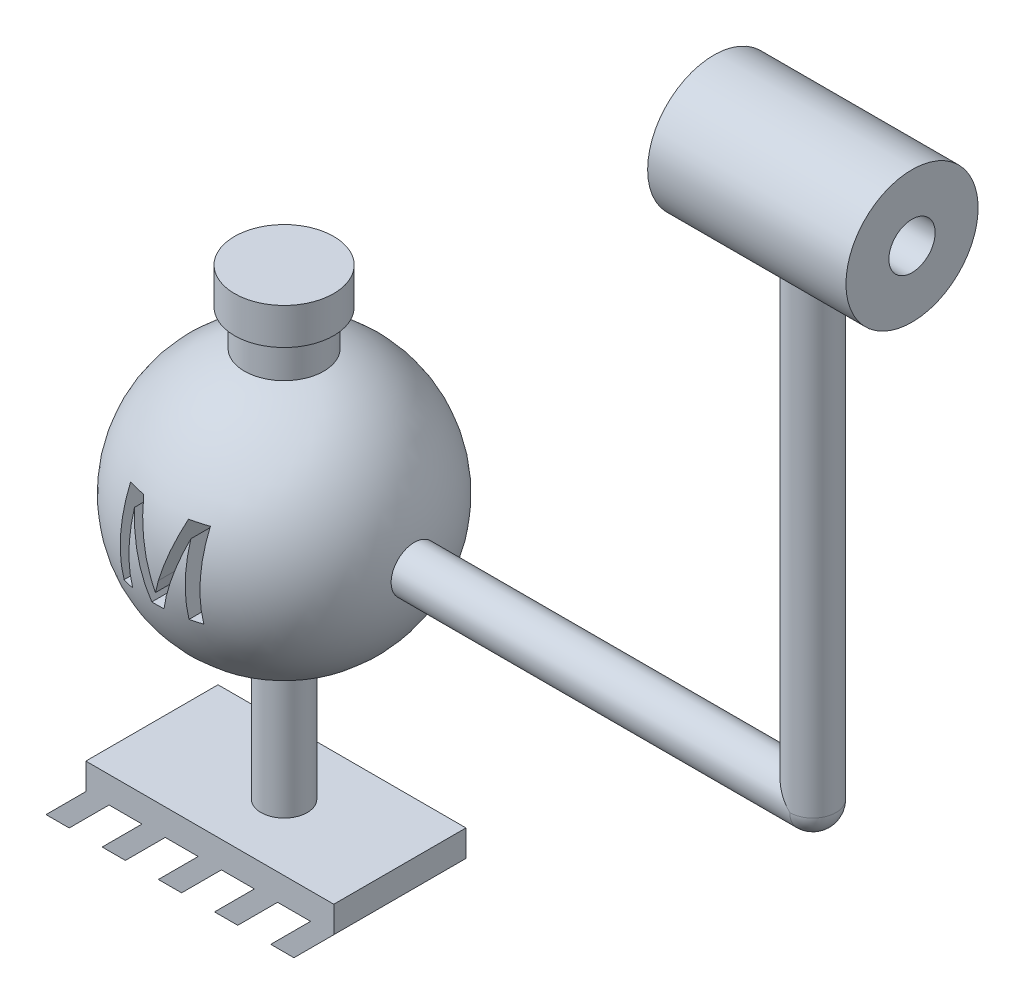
ISO-10303-21;
HEADER;
FILE_DESCRIPTION(('STEP AP214'),'2;1');
FILE_NAME('part.step','',(''),(''),'','','');
FILE_SCHEMA(('AUTOMOTIVE_DESIGN { 1 0 10303 214 1 1 1 1 }'));
ENDSEC;
DATA;
#1=APPLICATION_CONTEXT('core data for automotive mechanical design processes');
#2=APPLICATION_PROTOCOL_DEFINITION('international standard','automotive_design',2000,#1);
#3=PRODUCT_CONTEXT('',#1,'mechanical');
#4=PRODUCT('Part','Part','',(#3));
#5=PRODUCT_RELATED_PRODUCT_CATEGORY('part','',(#4));
#6=PRODUCT_DEFINITION_FORMATION('','',#4);
#7=PRODUCT_DEFINITION_CONTEXT('part definition',#1,'design');
#8=PRODUCT_DEFINITION('design','',#6,#7);
#9=PRODUCT_DEFINITION_SHAPE('','',#8);
#10=(LENGTH_UNIT() NAMED_UNIT(*) SI_UNIT(.MILLI.,.METRE.));
#11=(NAMED_UNIT(*) PLANE_ANGLE_UNIT() SI_UNIT($,.RADIAN.));
#12=(NAMED_UNIT(*) SI_UNIT($,.STERADIAN.) SOLID_ANGLE_UNIT());
#13=UNCERTAINTY_MEASURE_WITH_UNIT(LENGTH_MEASURE(1.E-05),#10,'distance_accuracy_value','');
#14=(GEOMETRIC_REPRESENTATION_CONTEXT(3) GLOBAL_UNCERTAINTY_ASSIGNED_CONTEXT((#13)) GLOBAL_UNIT_ASSIGNED_CONTEXT((#10,
#11,#12)) REPRESENTATION_CONTEXT('',''));
#15=CARTESIAN_POINT('',(0.,0.,0.));
#16=DIRECTION('',(0.,0.,1.));
#17=DIRECTION('',(1.,0.,0.));
#18=AXIS2_PLACEMENT_3D('',#15,#16,#17);
#19=CARTESIAN_POINT('',(20.,-44.,10.));
#20=DIRECTION('',(0.,1.,0.));
#21=DIRECTION('',(0.,0.,1.));
#22=AXIS2_PLACEMENT_3D('',#19,#20,#21);
#23=PLANE('',#22);
#24=DIRECTION('',(1.,0.,0.));
#25=VECTOR('',#24,1.);
#26=CARTESIAN_POINT('',(20.,-44.,-10.));
#27=LINE('',#26,#25);
#28=CARTESIAN_POINT('',(9.01288454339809,-44.,-10.));
#29=VERTEX_POINT('',#28);
#30=CARTESIAN_POINT('',(14.,-44.,-10.));
#31=VERTEX_POINT('',#30);
#32=EDGE_CURVE('E601',#29,#31,#27,.T.);
#33=ORIENTED_EDGE('',*,*,#32,.T.);
#34=DIRECTION('',(0.,0.,1.));
#35=VECTOR('',#34,1.);
#36=CARTESIAN_POINT('',(14.,-44.,-21.28254431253));
#37=LINE('',#36,#35);
#38=CARTESIAN_POINT('',(14.,-44.,10.));
#39=VERTEX_POINT('',#38);
#40=EDGE_CURVE('E56',#31,#39,#37,.T.);
#41=ORIENTED_EDGE('',*,*,#40,.T.);
#42=DIRECTION('',(-1.,0.,0.));
#43=VECTOR('',#42,1.);
#44=CARTESIAN_POINT('',(20.,-44.,10.));
#45=LINE('',#44,#43);
#46=CARTESIAN_POINT('',(9.0128845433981,-44.,10.));
#47=VERTEX_POINT('',#46);
#48=EDGE_CURVE('E612',#39,#47,#45,.T.);
#49=ORIENTED_EDGE('',*,*,#48,.T.);
#50=DIRECTION('',(0.,0.,1.));
#51=VECTOR('',#50,1.);
#52=CARTESIAN_POINT('',(9.01288454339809,-44.,-21.28254431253));
#53=LINE('',#52,#51);
#54=EDGE_CURVE('E496',#29,#47,#53,.T.);
#55=ORIENTED_EDGE('',*,*,#54,.F.);
#56=EDGE_LOOP('',(#33,#41,#49,#55));
#57=FACE_BOUND('',#56,.T.);
#58=ADVANCED_FACE('F32',(#57),#23,.F.);
#59=CARTESIAN_POINT('',(0.512884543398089,-44.,-10.));
#60=VERTEX_POINT('',#59);
#61=CARTESIAN_POINT('',(5.50000000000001,-44.,-10.));
#62=VERTEX_POINT('',#61);
#63=EDGE_CURVE('E586',#60,#62,#27,.T.);
#64=ORIENTED_EDGE('',*,*,#63,.T.);
#65=DIRECTION('',(0.,0.,1.));
#66=VECTOR('',#65,1.);
#67=CARTESIAN_POINT('',(5.50000000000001,-44.,-21.28254431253));
#68=LINE('',#67,#66);
#69=CARTESIAN_POINT('',(5.50000000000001,-44.,10.));
#70=VERTEX_POINT('',#69);
#71=EDGE_CURVE('E482',#62,#70,#68,.T.);
#72=ORIENTED_EDGE('',*,*,#71,.T.);
#73=CARTESIAN_POINT('',(0.512884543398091,-44.,10.));
#74=VERTEX_POINT('',#73);
#75=EDGE_CURVE('E603',#70,#74,#45,.T.);
#76=ORIENTED_EDGE('',*,*,#75,.T.);
#77=DIRECTION('',(0.,0.,1.));
#78=VECTOR('',#77,1.);
#79=CARTESIAN_POINT('',(0.512884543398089,-44.,-21.28254431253));
#80=LINE('',#79,#78);
#81=EDGE_CURVE('E521',#60,#74,#80,.T.);
#82=ORIENTED_EDGE('',*,*,#81,.F.);
#83=EDGE_LOOP('',(#64,#72,#76,#82));
#84=FACE_BOUND('',#83,.T.);
#85=ADVANCED_FACE('F658',(#84),#23,.F.);
#86=CARTESIAN_POINT('',(-7.98711545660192,-44.,-10.));
#87=VERTEX_POINT('',#86);
#88=CARTESIAN_POINT('',(-2.99999999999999,-44.,-10.));
#89=VERTEX_POINT('',#88);
#90=EDGE_CURVE('E584',#87,#89,#27,.T.);
#91=ORIENTED_EDGE('',*,*,#90,.T.);
#92=DIRECTION('',(0.,0.,1.));
#93=VECTOR('',#92,1.);
#94=CARTESIAN_POINT('',(-2.99999999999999,-44.,-21.28254431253));
#95=LINE('',#94,#93);
#96=CARTESIAN_POINT('',(-2.99999999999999,-44.,10.));
#97=VERTEX_POINT('',#96);
#98=EDGE_CURVE('E507',#89,#97,#95,.T.);
#99=ORIENTED_EDGE('',*,*,#98,.T.);
#100=CARTESIAN_POINT('',(-7.98711545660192,-44.,10.));
#101=VERTEX_POINT('',#100);
#102=EDGE_CURVE('E602',#97,#101,#45,.T.);
#103=ORIENTED_EDGE('',*,*,#102,.T.);
#104=DIRECTION('',(0.,0.,1.));
#105=VECTOR('',#104,1.);
#106=CARTESIAN_POINT('',(-7.98711545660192,-44.,-21.28254431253));
#107=LINE('',#106,#105);
#108=EDGE_CURVE('E546',#87,#101,#107,.T.);
#109=ORIENTED_EDGE('',*,*,#108,.F.);
#110=EDGE_LOOP('',(#91,#99,#103,#109));
#111=FACE_BOUND('',#110,.T.);
#112=ADVANCED_FACE('F671',(#111),#23,.F.);
#113=CARTESIAN_POINT('',(-16.4871154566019,-44.,-10.));
#114=VERTEX_POINT('',#113);
#115=CARTESIAN_POINT('',(-11.5,-44.,-10.));
#116=VERTEX_POINT('',#115);
#117=EDGE_CURVE('E572',#114,#116,#27,.T.);
#118=ORIENTED_EDGE('',*,*,#117,.T.);
#119=DIRECTION('',(0.,0.,1.));
#120=VECTOR('',#119,1.);
#121=CARTESIAN_POINT('',(-11.5,-44.,-21.28254431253));
#122=LINE('',#121,#120);
#123=CARTESIAN_POINT('',(-11.5,-44.,10.));
#124=VERTEX_POINT('',#123);
#125=EDGE_CURVE('E532',#116,#124,#122,.T.);
#126=ORIENTED_EDGE('',*,*,#125,.T.);
#127=CARTESIAN_POINT('',(-16.4871154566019,-44.,10.));
#128=VERTEX_POINT('',#127);
#129=EDGE_CURVE('E587',#124,#128,#45,.T.);
#130=ORIENTED_EDGE('',*,*,#129,.T.);
#131=DIRECTION('',(0.,0.,1.));
#132=VECTOR('',#131,1.);
#133=CARTESIAN_POINT('',(-16.4871154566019,-44.,-21.28254431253));
#134=LINE('',#133,#132);
#135=EDGE_CURVE('E557',#114,#128,#134,.T.);
#136=ORIENTED_EDGE('',*,*,#135,.F.);
#137=EDGE_LOOP('',(#118,#126,#130,#136));
#138=FACE_BOUND('',#137,.T.);
#139=ADVANCED_FACE('F709',(#138),#23,.F.);
#140=CARTESIAN_POINT('',(80.,0.,0.));
#141=DIRECTION('',(-1.,0.,0.));
#142=DIRECTION('',(0.,0.,1.));
#143=AXIS2_PLACEMENT_3D('',#140,#141,#142);
#144=CYLINDRICAL_SURFACE('',#143,3.5);
#145=CARTESIAN_POINT('',(19.6913686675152,0.,0.));
#146=DIRECTION('',(-1.,0.,0.));
#147=DIRECTION('',(0.,0.,1.));
#148=AXIS2_PLACEMENT_3D('',#145,#146,#147);
#149=CIRCLE('',#148,3.5);
#150=CARTESIAN_POINT('',(19.6913686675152,0.,3.5));
#151=VERTEX_POINT('',#150);
#152=EDGE_CURVE('E736',#151,#151,#149,.T.);
#153=ORIENTED_EDGE('',*,*,#152,.F.);
#154=EDGE_LOOP('',(#153));
#155=FACE_BOUND('',#154,.T.);
#156=CARTESIAN_POINT('',(80.,0.,0.));
#157=DIRECTION('',(-0.707106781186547,-0.707106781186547,0.));
#158=DIRECTION('',(-0.707106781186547,0.707106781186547,0.));
#159=AXIS2_PLACEMENT_3D('',#156,#157,#158);
#160=ELLIPSE('',#159,4.94974746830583,3.5);
#161=CARTESIAN_POINT('',(80.,0.,-3.49999999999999));
#162=VERTEX_POINT('',#161);
#163=CARTESIAN_POINT('',(80.,0.,3.5));
#164=VERTEX_POINT('',#163);
#165=EDGE_CURVE('E731',#162,#164,#160,.F.);
#166=ORIENTED_EDGE('',*,*,#165,.F.);
#167=CARTESIAN_POINT('',(80.,0.,0.));
#168=DIRECTION('',(1.,0.,0.));
#169=DIRECTION('',(0.,0.,-1.));
#170=AXIS2_PLACEMENT_3D('',#167,#168,#169);
#171=CIRCLE('',#170,3.5);
#172=EDGE_CURVE('E734',#164,#162,#171,.T.);
#173=ORIENTED_EDGE('',*,*,#172,.F.);
#174=EDGE_LOOP('',(#166,#173));
#175=FACE_BOUND('',#174,.T.);
#176=ADVANCED_FACE('F786',(#155,#175),#144,.T.);
#177=CARTESIAN_POINT('',(0.,0.,0.));
#178=DIRECTION('',(0.,1.,0.));
#179=DIRECTION('',(0.,0.,1.));
#180=AXIS2_PLACEMENT_3D('',#177,#178,#179);
#181=SPHERICAL_SURFACE('',#180,20.);
#182=CARTESIAN_POINT('',(0.,-4.72713934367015,0.));
#183=DIRECTION('',(0.,-1.,0.));
#184=DIRECTION('',(0.,0.,-1.));
#185=AXIS2_PLACEMENT_3D('',#182,#183,#184);
#186=CIRCLE('',#185,19.4333258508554);
#187=CARTESIAN_POINT('',(-5.5969357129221,-4.72713934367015,18.6099023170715));
#188=VERTEX_POINT('',#187);
#189=CARTESIAN_POINT('',(-3.85838152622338,-4.72713934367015,19.0464444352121));
#190=VERTEX_POINT('',#189);
#191=EDGE_CURVE('E11',#188,#190,#186,.F.);
#192=ORIENTED_EDGE('',*,*,#191,.F.);
#193=CARTESIAN_POINT('',(-5.5969357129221,0.,0.));
#194=DIRECTION('',(-1.,0.,0.));
#195=DIRECTION('',(0.,0.,1.));
#196=AXIS2_PLACEMENT_3D('',#193,#194,#195);
#197=CIRCLE('',#196,19.2008934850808);
#198=CARTESIAN_POINT('',(-5.5969357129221,7.60079034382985,17.6324217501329));
#199=VERTEX_POINT('',#198);
#200=EDGE_CURVE('E280',#199,#188,#197,.F.);
#201=ORIENTED_EDGE('',*,*,#200,.F.);
#202=CARTESIAN_POINT('',(0.,7.60079034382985,0.));
#203=DIRECTION('',(0.,1.,0.));
#204=DIRECTION('',(0.,0.,1.));
#205=AXIS2_PLACEMENT_3D('',#202,#203,#204);
#206=CIRCLE('',#205,18.4994050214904);
#207=CARTESIAN_POINT('',(-2.98169582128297,7.60079034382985,18.2575320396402));
#208=VERTEX_POINT('',#207);
#209=EDGE_CURVE('E1237',#208,#199,#206,.F.);
#210=ORIENTED_EDGE('',*,*,#209,.F.);
#211=CARTESIAN_POINT('',(-0.508585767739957,-0.162027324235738,0.));
#212=DIRECTION('',(0.95281497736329,0.303551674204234,0.));
#213=DIRECTION('',(-0.303551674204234,0.95281497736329,0.));
#214=AXIS2_PLACEMENT_3D('',#211,#212,#213);
#215=CIRCLE('',#214,19.9928759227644);
#216=CARTESIAN_POINT('',(-0.225692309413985,-1.04999845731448,19.971143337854));
#217=VERTEX_POINT('',#216);
#218=EDGE_CURVE('E378',#217,#208,#215,.F.);
#219=ORIENTED_EDGE('',*,*,#218,.F.);
#220=CARTESIAN_POINT('',(0.329953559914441,-2.86016922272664,19.7916791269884));
#221=CARTESIAN_POINT('',(0.324520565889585,-2.84134018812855,19.794490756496));
#222=CARTESIAN_POINT('',(0.319087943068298,-2.82250658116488,19.7972733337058));
#223=CARTESIAN_POINT('',(0.308171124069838,-2.78484573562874,19.8027790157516));
#224=CARTESIAN_POINT('',(0.302686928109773,-2.76601849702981,19.8055021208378));
#225=CARTESIAN_POINT('',(0.291614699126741,-2.72838607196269,19.8108874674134));
#226=CARTESIAN_POINT('',(0.286026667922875,-2.70958088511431,19.8135497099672));
#227=CARTESIAN_POINT('',(0.274713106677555,-2.67200333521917,19.8188123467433));
#228=CARTESIAN_POINT('',(0.268987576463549,-2.65323097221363,19.821412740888));
#229=CARTESIAN_POINT('',(0.251729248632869,-2.59692691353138,19.8291243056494));
#230=CARTESIAN_POINT('',(0.240114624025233,-2.55940794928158,19.8341459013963));
#231=CARTESIAN_POINT('',(0.217273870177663,-2.48422275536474,19.8439662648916));
#232=CARTESIAN_POINT('',(0.206047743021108,-2.44655652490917,19.8487650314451));
#233=CARTESIAN_POINT('',(0.18354419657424,-2.37121453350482,19.8581273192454));
#234=CARTESIAN_POINT('',(0.172266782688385,-2.33353877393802,19.8626908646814));
#235=CARTESIAN_POINT('',(0.149384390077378,-2.25825825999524,19.8715757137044));
#236=CARTESIAN_POINT('',(0.1377794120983,-2.22065350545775,19.8758970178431));
#237=CARTESIAN_POINT('',(0.114584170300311,-2.14541395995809,19.8843062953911));
#238=CARTESIAN_POINT('',(0.102993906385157,-2.10777916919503,19.8883942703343));
#239=CARTESIAN_POINT('',(0.0799448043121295,-2.03244498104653,19.8963399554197));
#240=CARTESIAN_POINT('',(0.0684859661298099,-1.99474558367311,19.9001976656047));
#241=CARTESIAN_POINT('',(0.0512478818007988,-1.93814863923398,19.9058118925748));
#242=CARTESIAN_POINT('',(0.0454871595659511,-1.91925412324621,19.907656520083));
#243=CARTESIAN_POINT('',(0.0339362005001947,-1.88146842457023,19.911286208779));
#244=CARTESIAN_POINT('',(0.0281459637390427,-1.86257724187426,19.9130712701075));
#245=CARTESIAN_POINT('',(0.0107215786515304,-1.80591225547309,19.9183367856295));
#246=CARTESIAN_POINT('',(-0.000966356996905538,-1.76814664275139,19.9217276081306));
#247=CARTESIAN_POINT('',(-0.0362327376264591,-1.65488201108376,19.9315415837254));
#248=CARTESIAN_POINT('',(-0.0600138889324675,-1.57941476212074,19.9376062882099));
#249=CARTESIAN_POINT('',(-0.095782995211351,-1.46616904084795,19.9459958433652));
#250=CARTESIAN_POINT('',(-0.107725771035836,-1.42840192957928,19.9486751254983));
#251=CARTESIAN_POINT('',(-0.131523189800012,-1.35282412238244,19.9538002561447));
#252=CARTESIAN_POINT('',(-0.143377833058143,-1.31501342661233,19.9562461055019));
#253=CARTESIAN_POINT('',(-0.166995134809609,-1.23934895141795,19.9609043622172));
#254=CARTESIAN_POINT('',(-0.178757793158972,-1.20149517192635,19.96311676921));
#255=CARTESIAN_POINT('',(-0.202242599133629,-1.12576177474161,19.9673066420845));
#256=CARTESIAN_POINT('',(-0.213964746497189,-1.08788215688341,19.969284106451));
#257=CARTESIAN_POINT('',(-0.225692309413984,-1.04999845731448,19.971143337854));
#258=B_SPLINE_CURVE_WITH_KNOTS('',3,(#220,#221,#222,#223,#224,#225,#226,#227,#228,#229,#230,
#231,#232,#233,#234,#235,#236,#237,#238,#239,#240,#241,#242,#243,#244,#245,#246,#247,#248,#249,
#250,#251,#252,#253,#254,#255,#256,#257),.UNSPECIFIED.,.F.,.F.,(4,2,2,2,2,2,2,2,2,2,2,2,2,2,2,2,
2,2,4),(0.,0.0593937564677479,0.118787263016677,0.178179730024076,0.237572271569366,
0.356356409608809,0.475141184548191,0.593913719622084,0.712685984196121,0.831457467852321,
0.95022892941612,1.00974626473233,1.06926345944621,1.18829668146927,1.42636175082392,
1.54546404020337,1.66456589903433,1.78366794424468,1.90277075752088),.UNSPECIFIED.);
#259=CARTESIAN_POINT('',(0.329953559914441,-2.86016922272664,19.7916791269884));
#260=VERTEX_POINT('',#259);
#261=EDGE_CURVE('E371',#260,#217,#258,.T.);
#262=ORIENTED_EDGE('',*,*,#261,.F.);
#263=CARTESIAN_POINT('',(0.934990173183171,-0.901826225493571,19.9577679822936));
#264=CARTESIAN_POINT('',(0.922217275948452,-0.942644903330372,19.9565219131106));
#265=CARTESIAN_POINT('',(0.909456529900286,-0.983463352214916,19.9551376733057));
#266=CARTESIAN_POINT('',(0.883862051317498,-1.06506685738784,19.9520989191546));
#267=CARTESIAN_POINT('',(0.871028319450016,-1.10585191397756,19.9504444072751));
#268=CARTESIAN_POINT('',(0.845189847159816,-1.18735803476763,19.9468710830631));
#269=CARTESIAN_POINT('',(0.832185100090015,-1.22807909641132,19.9449522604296));
#270=CARTESIAN_POINT('',(0.80606751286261,-1.30947225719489,19.9408467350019));
#271=CARTESIAN_POINT('',(0.792954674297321,-1.35014435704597,19.9386600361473));
#272=CARTESIAN_POINT('',(0.770138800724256,-1.42139673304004,19.934581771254));
#273=CARTESIAN_POINT('',(0.760399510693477,-1.45196888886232,19.9327522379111));
#274=CARTESIAN_POINT('',(0.741134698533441,-1.5131699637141,19.928925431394));
#275=CARTESIAN_POINT('',(0.731609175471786,-1.54379888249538,19.9269281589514));
#276=CARTESIAN_POINT('',(0.712722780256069,-1.60509668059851,19.9227689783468));
#277=CARTESIAN_POINT('',(0.703361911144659,-1.63576556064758,19.9206070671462));
#278=CARTESIAN_POINT('',(0.684688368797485,-1.69710669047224,19.9161257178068));
#279=CARTESIAN_POINT('',(0.675375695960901,-1.7277789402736,19.9138062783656));
#280=CARTESIAN_POINT('',(0.656688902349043,-1.78909290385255,19.9090165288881));
#281=CARTESIAN_POINT('',(0.647314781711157,-1.81973461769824,19.906546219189));
#282=CARTESIAN_POINT('',(0.628463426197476,-1.88097365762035,19.9014573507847));
#283=CARTESIAN_POINT('',(0.618986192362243,-1.91157098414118,19.8988387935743));
#284=CARTESIAN_POINT('',(0.599914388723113,-1.97271571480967,19.8934544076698));
#285=CARTESIAN_POINT('',(0.590319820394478,-2.00326311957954,19.8906885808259));
#286=CARTESIAN_POINT('',(0.570988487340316,-2.06429976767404,19.8850112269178));
#287=CARTESIAN_POINT('',(0.561251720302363,-2.09478901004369,19.8820996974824));
#288=CARTESIAN_POINT('',(0.541802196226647,-2.15581657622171,19.8761148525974));
#289=CARTESIAN_POINT('',(0.532089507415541,-2.18635489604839,19.8730412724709));
#290=CARTESIAN_POINT('',(0.512940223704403,-2.24749986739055,19.8667227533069));
#291=CARTESIAN_POINT('',(0.50350362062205,-2.27810651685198,19.8634778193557));
#292=CARTESIAN_POINT('',(0.4849489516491,-2.33939717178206,19.8568144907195));
#293=CARTESIAN_POINT('',(0.475830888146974,-2.37008117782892,19.8533960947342));
#294=CARTESIAN_POINT('',(0.457645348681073,-2.43144675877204,19.8464017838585));
#295=CARTESIAN_POINT('',(0.448577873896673,-2.46212833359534,19.8428258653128));
#296=CARTESIAN_POINT('',(0.430302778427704,-2.52343143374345,19.8355279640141));
#297=CARTESIAN_POINT('',(0.421095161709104,-2.55405296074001,19.8318059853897));
#298=CARTESIAN_POINT('',(0.402673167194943,-2.61527461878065,19.8242081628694));
#299=CARTESIAN_POINT('',(0.393458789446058,-2.64587474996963,19.8203323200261));
#300=CARTESIAN_POINT('',(0.375158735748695,-2.7070917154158,19.8124189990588));
#301=CARTESIAN_POINT('',(0.366073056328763,-2.73770854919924,19.8083815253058));
#302=CARTESIAN_POINT('',(0.347973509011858,-2.79894290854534,19.8001482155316));
#303=CARTESIAN_POINT('',(0.338959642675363,-2.82956043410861,19.7959523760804));
#304=CARTESIAN_POINT('',(0.329953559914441,-2.86016922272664,19.7916791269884));
#305=B_SPLINE_CURVE_WITH_KNOTS('',3,(#263,#264,#265,#266,#267,#268,#269,#270,#271,#272,#273,
#274,#275,#276,#277,#278,#279,#280,#281,#282,#283,#284,#285,#286,#287,#288,#289,#290,#291,#292,
#293,#294,#295,#296,#297,#298,#299,#300,#301,#302,#303,#304),.UNSPECIFIED.,.F.,.F.,(4,2,2,2,2,2,
2,2,2,2,2,2,2,2,2,2,2,2,2,2,4),(0.,0.128365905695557,0.256730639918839,0.385100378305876,
0.513468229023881,0.609881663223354,0.706294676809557,0.802709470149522,0.899125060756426,
0.995540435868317,1.09195483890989,1.18836803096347,1.28478279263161,1.38136022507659,
1.47793479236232,1.57451008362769,1.67108761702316,1.76766242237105,1.86423656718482,
1.96080810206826,2.05738172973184),.UNSPECIFIED.);
#306=CARTESIAN_POINT('',(0.934990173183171,-0.901826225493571,19.9577679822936));
#307=VERTEX_POINT('',#306);
#308=EDGE_CURVE('E377',#307,#260,#305,.T.);
#309=ORIENTED_EDGE('',*,*,#308,.F.);
#310=CARTESIAN_POINT('',(1.11008134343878,-0.356270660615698,0.));
#311=DIRECTION('',(-0.952163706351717,0.305588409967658,0.));
#312=DIRECTION('',(-0.305588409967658,-0.952163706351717,0.));
#313=AXIS2_PLACEMENT_3D('',#310,#311,#312);
#314=CIRCLE('',#313,19.9659908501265);
#315=CARTESIAN_POINT('',(3.66382877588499,7.60079034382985,18.1329629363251));
#316=VERTEX_POINT('',#315);
#317=EDGE_CURVE('E384',#316,#307,#314,.F.);
#318=ORIENTED_EDGE('',*,*,#317,.F.);
#319=CARTESIAN_POINT('',(0.,7.60079034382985,0.));
#320=DIRECTION('',(0.,1.,0.));
#321=DIRECTION('',(0.,0.,1.));
#322=AXIS2_PLACEMENT_3D('',#319,#320,#321);
#323=CIRCLE('',#322,18.4994050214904);
#324=CARTESIAN_POINT('',(6.25684283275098,7.60079034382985,17.4091902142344));
#325=VERTEX_POINT('',#324);
#326=EDGE_CURVE('E386',#325,#316,#323,.F.);
#327=ORIENTED_EDGE('',*,*,#326,.F.);
#328=CARTESIAN_POINT('',(6.25684283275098,0.,0.));
#329=DIRECTION('',(1.,0.,0.));
#330=DIRECTION('',(0.,0.,-1.));
#331=AXIS2_PLACEMENT_3D('',#328,#329,#330);
#332=CIRCLE('',#331,18.9961026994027);
#333=CARTESIAN_POINT('',(6.25684283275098,-4.72713934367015,18.3985344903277));
#334=VERTEX_POINT('',#333);
#335=EDGE_CURVE('E388',#334,#325,#332,.F.);
#336=ORIENTED_EDGE('',*,*,#335,.F.);
#337=CARTESIAN_POINT('',(0.,-4.72713934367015,0.));
#338=DIRECTION('',(0.,-1.,0.));
#339=DIRECTION('',(0.,0.,-1.));
#340=AXIS2_PLACEMENT_3D('',#337,#338,#339);
#341=CIRCLE('',#340,19.4333258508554);
#342=CARTESIAN_POINT('',(4.51828864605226,-4.72713934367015,18.9007730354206));
#343=VERTEX_POINT('',#342);
#344=EDGE_CURVE('E390',#343,#334,#341,.F.);
#345=ORIENTED_EDGE('',*,*,#344,.F.);
#346=CARTESIAN_POINT('',(4.51828864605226,0.,0.));
#347=DIRECTION('',(-1.,0.,0.));
#348=DIRECTION('',(0.,0.,1.));
#349=AXIS2_PLACEMENT_3D('',#346,#347,#348);
#350=CIRCLE('',#349,19.4829429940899);
#351=CARTESIAN_POINT('',(4.51828864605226,5.70418577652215,18.6292064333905));
#352=VERTEX_POINT('',#351);
#353=EDGE_CURVE('E392',#352,#343,#350,.F.);
#354=ORIENTED_EDGE('',*,*,#353,.F.);
#355=CARTESIAN_POINT('',(2.47355543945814,-0.780013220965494,0.));
#356=DIRECTION('',(0.953705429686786,-0.300742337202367,0.));
#357=DIRECTION('',(0.300742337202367,0.953705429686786,0.));
#358=AXIS2_PLACEMENT_3D('',#355,#356,#357);
#359=CIRCLE('',#358,19.8311145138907);
#360=CARTESIAN_POINT('',(1.22886509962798,-4.72713934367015,19.3944333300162));
#361=VERTEX_POINT('',#360);
#362=EDGE_CURVE('E394',#361,#352,#359,.F.);
#363=ORIENTED_EDGE('',*,*,#362,.F.);
#364=CARTESIAN_POINT('',(0.,-4.72713934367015,0.));
#365=DIRECTION('',(0.,-1.,0.));
#366=DIRECTION('',(0.,0.,-1.));
#367=AXIS2_PLACEMENT_3D('',#364,#365,#366);
#368=CIRCLE('',#367,19.4333258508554);
#369=CARTESIAN_POINT('',(-0.588714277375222,-4.72713934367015,19.4244065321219));
#370=VERTEX_POINT('',#369);
#371=EDGE_CURVE('E396',#370,#361,#368,.F.);
#372=ORIENTED_EDGE('',*,*,#371,.F.);
#373=CARTESIAN_POINT('',(-1.88520251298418,-0.590911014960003,0.));
#374=DIRECTION('',(-0.954222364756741,-0.299098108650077,0.));
#375=DIRECTION('',(0.299098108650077,-0.954222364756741,0.));
#376=AXIS2_PLACEMENT_3D('',#373,#374,#375);
#377=CIRCLE('',#376,19.9021816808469);
#378=CARTESIAN_POINT('',(-3.85838152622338,5.70418577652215,18.7769847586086));
#379=VERTEX_POINT('',#378);
#380=EDGE_CURVE('E398',#379,#370,#377,.F.);
#381=ORIENTED_EDGE('',*,*,#380,.F.);
#382=CARTESIAN_POINT('',(-3.85838152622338,0.,0.));
#383=DIRECTION('',(1.,0.,0.));
#384=DIRECTION('',(0.,0.,-1.));
#385=AXIS2_PLACEMENT_3D('',#382,#383,#384);
#386=CIRCLE('',#385,19.624293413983);
#387=EDGE_CURVE('E41',#190,#379,#386,.F.);
#388=ORIENTED_EDGE('',*,*,#387,.F.);
#389=EDGE_LOOP('',(#192,#201,#210,#219,#262,#309,#318,#327,#336,#345,#354,#363,#372,#381,#388));
#390=FACE_BOUND('',#389,.T.);
#391=CARTESIAN_POINT('',(0.,-19.6913686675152,0.));
#392=DIRECTION('',(0.,1.,0.));
#393=DIRECTION('',(0.,0.,1.));
#394=AXIS2_PLACEMENT_3D('',#391,#392,#393);
#395=CIRCLE('',#394,3.5);
#396=CARTESIAN_POINT('',(0.,-19.6913686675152,3.5));
#397=VERTEX_POINT('',#396);
#398=EDGE_CURVE('E749',#397,#397,#395,.F.);
#399=ORIENTED_EDGE('',*,*,#398,.F.);
#400=EDGE_LOOP('',(#399));
#401=FACE_BOUND('',#400,.T.);
#402=CARTESIAN_POINT('',(0.,19.0787840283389,0.));
#403=DIRECTION('',(0.,1.,0.));
#404=DIRECTION('',(0.,0.,1.));
#405=AXIS2_PLACEMENT_3D('',#402,#403,#404);
#406=CIRCLE('',#405,6.);
#407=CARTESIAN_POINT('',(0.,19.0787840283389,6.));
#408=VERTEX_POINT('',#407);
#409=EDGE_CURVE('E737',#408,#408,#406,.T.);
#410=ORIENTED_EDGE('',*,*,#409,.F.);
#411=EDGE_LOOP('',(#410));
#412=FACE_BOUND('',#411,.T.);
#413=ORIENTED_EDGE('',*,*,#152,.T.);
#414=EDGE_LOOP('',(#413));
#415=FACE_BOUND('',#414,.T.);
#416=ADVANCED_FACE('F34',(#390,#401,#412,#415),#181,.T.);
#417=CARTESIAN_POINT('',(0.,30.,7.5));
#418=DIRECTION('',(0.,1.,0.));
#419=DIRECTION('',(0.,0.,1.));
#420=AXIS2_PLACEMENT_3D('',#417,#418,#419);
#421=PLANE('',#420);
#422=CARTESIAN_POINT('',(0.,30.,0.));
#423=DIRECTION('',(0.,1.,0.));
#424=DIRECTION('',(0.,0.,1.));
#425=AXIS2_PLACEMENT_3D('',#422,#423,#424);
#426=CIRCLE('',#425,7.5);
#427=CARTESIAN_POINT('',(0.,30.,7.5));
#428=VERTEX_POINT('',#427);
#429=EDGE_CURVE('E746',#428,#428,#426,.T.);
#430=ORIENTED_EDGE('',*,*,#429,.T.);
#431=EDGE_LOOP('',(#430));
#432=FACE_BOUND('',#431,.T.);
#433=ADVANCED_FACE('F895',(#432),#421,.T.);
#434=CARTESIAN_POINT('',(0.,50.2447108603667,0.));
#435=DIRECTION('',(0.,1.,0.));
#436=DIRECTION('',(0.,0.,1.));
#437=AXIS2_PLACEMENT_3D('',#434,#435,#436);
#438=CYLINDRICAL_SURFACE('',#437,7.5);
#439=CARTESIAN_POINT('',(0.,24.4829337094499,0.));
#440=DIRECTION('',(0.,1.,0.));
#441=DIRECTION('',(0.,0.,1.));
#442=AXIS2_PLACEMENT_3D('',#439,#440,#441);
#443=CIRCLE('',#442,7.5);
#444=CARTESIAN_POINT('',(0.,24.4829337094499,7.5));
#445=VERTEX_POINT('',#444);
#446=EDGE_CURVE('E743',#445,#445,#443,.T.);
#447=ORIENTED_EDGE('',*,*,#446,.T.);
#448=EDGE_LOOP('',(#447));
#449=FACE_BOUND('',#448,.T.);
#450=ORIENTED_EDGE('',*,*,#429,.F.);
#451=EDGE_LOOP('',(#450));
#452=FACE_BOUND('',#451,.T.);
#453=ADVANCED_FACE('F885',(#449,#452),#438,.T.);
#454=CARTESIAN_POINT('',(0.,24.4829337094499,7.5));
#455=DIRECTION('',(0.,-1.,0.));
#456=DIRECTION('',(0.,0.,-1.));
#457=AXIS2_PLACEMENT_3D('',#454,#455,#456);
#458=PLANE('',#457);
#459=CARTESIAN_POINT('',(0.,24.4829337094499,0.));
#460=DIRECTION('',(0.,1.,0.));
#461=DIRECTION('',(0.,0.,1.));
#462=AXIS2_PLACEMENT_3D('',#459,#460,#461);
#463=CIRCLE('',#462,6.);
#464=CARTESIAN_POINT('',(0.,24.4829337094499,6.));
#465=VERTEX_POINT('',#464);
#466=EDGE_CURVE('E740',#465,#465,#463,.T.);
#467=ORIENTED_EDGE('',*,*,#466,.T.);
#468=EDGE_LOOP('',(#467));
#469=FACE_BOUND('',#468,.T.);
#470=ORIENTED_EDGE('',*,*,#446,.F.);
#471=EDGE_LOOP('',(#470));
#472=FACE_BOUND('',#471,.T.);
#473=ADVANCED_FACE('F875',(#469,#472),#458,.T.);
#474=CARTESIAN_POINT('',(0.,50.2447108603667,0.));
#475=DIRECTION('',(0.,1.,0.));
#476=DIRECTION('',(0.,0.,1.));
#477=AXIS2_PLACEMENT_3D('',#474,#475,#476);
#478=CYLINDRICAL_SURFACE('',#477,6.);
#479=ORIENTED_EDGE('',*,*,#409,.T.);
#480=EDGE_LOOP('',(#479));
#481=FACE_BOUND('',#480,.T.);
#482=ORIENTED_EDGE('',*,*,#466,.F.);
#483=EDGE_LOOP('',(#482));
#484=FACE_BOUND('',#483,.T.);
#485=ADVANCED_FACE('F853',(#481,#484),#478,.T.);
#486=CARTESIAN_POINT('',(80.,80.,0.));
#487=DIRECTION('',(0.,-1.,0.));
#488=DIRECTION('',(0.,0.,-1.));
#489=AXIS2_PLACEMENT_3D('',#486,#487,#488);
#490=CYLINDRICAL_SURFACE('',#489,3.49999999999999);
#491=CARTESIAN_POINT('',(80.,70.6325030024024,-3.49999999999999));
#492=CARTESIAN_POINT('',(80.1900152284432,70.6325055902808,-3.50000305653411));
#493=CARTESIAN_POINT('',(80.3800091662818,70.6266583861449,-3.48447405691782));
#494=CARTESIAN_POINT('',(80.754329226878,70.6040389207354,-3.42300568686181));
#495=CARTESIAN_POINT('',(80.9386548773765,70.5872657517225,-3.37706378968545));
#496=CARTESIAN_POINT('',(81.2961466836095,70.5449220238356,-3.25661257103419));
#497=CARTESIAN_POINT('',(81.4693356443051,70.5193701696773,-3.18216395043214));
#498=CARTESIAN_POINT('',(81.8008267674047,70.462376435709,-3.00702321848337));
#499=CARTESIAN_POINT('',(81.9591251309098,70.4309330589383,-2.90632443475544));
#500=CARTESIAN_POINT('',(82.2631786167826,70.3641765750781,-2.67688293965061));
#501=CARTESIAN_POINT('',(82.4081978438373,70.3287600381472,-2.54719487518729));
#502=CARTESIAN_POINT('',(82.6749374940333,70.2589174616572,-2.26546916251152));
#503=CARTESIAN_POINT('',(82.7966537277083,70.2244916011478,-2.11342750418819));
#504=CARTESIAN_POINT('',(83.0167501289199,70.159299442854,-1.78585018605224));
#505=CARTESIAN_POINT('',(83.1143480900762,70.1286688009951,-1.60975957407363));
#506=CARTESIAN_POINT('',(83.2782396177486,70.0757463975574,-1.24240143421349));
#507=CARTESIAN_POINT('',(83.3445425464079,70.0534521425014,-1.05113846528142));
#508=CARTESIAN_POINT('',(83.4414335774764,70.0204476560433,-0.666588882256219));
#509=CARTESIAN_POINT('',(83.4732847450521,70.0093288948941,-0.473656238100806));
#510=CARTESIAN_POINT('',(83.5043961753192,69.9984718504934,-0.0848856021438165));
#511=CARTESIAN_POINT('',(83.5036656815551,69.9987303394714,0.110951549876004));
#512=CARTESIAN_POINT('',(83.4704103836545,70.0103283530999,0.490988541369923));
#513=CARTESIAN_POINT('',(83.4392599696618,70.0211888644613,0.675325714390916));
#514=CARTESIAN_POINT('',(83.3483369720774,70.0521588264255,1.03596846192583));
#515=CARTESIAN_POINT('',(83.288562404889,70.072268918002,1.21227347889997));
#516=CARTESIAN_POINT('',(83.1413506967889,70.1200613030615,1.55471483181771));
#517=CARTESIAN_POINT('',(83.0535437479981,70.147844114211,1.72067758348));
#518=CARTESIAN_POINT('',(82.853072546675,70.2081207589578,2.03590117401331));
#519=CARTESIAN_POINT('',(82.7404009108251,70.2406159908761,2.18515703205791));
#520=CARTESIAN_POINT('',(82.4865878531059,70.308898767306,2.47087991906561));
#521=CARTESIAN_POINT('',(82.3442779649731,70.3447696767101,2.60629061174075));
#522=CARTESIAN_POINT('',(82.0386960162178,70.4143763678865,2.85168878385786));
#523=CARTESIAN_POINT('',(81.8754200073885,70.4481117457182,2.9616714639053));
#524=CARTESIAN_POINT('',(81.5288799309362,70.5101117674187,3.15476153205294));
#525=CARTESIAN_POINT('',(81.3453213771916,70.5382727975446,3.23737626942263));
#526=CARTESIAN_POINT('',(80.9656586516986,70.5847404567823,3.37014757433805));
#527=CARTESIAN_POINT('',(80.7695604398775,70.6030517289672,3.42031943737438));
#528=CARTESIAN_POINT('',(80.3807032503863,70.6266789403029,3.48453330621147));
#529=CARTESIAN_POINT('',(80.188253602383,70.6325891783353,3.50022937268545));
#530=CARTESIAN_POINT('',(79.8034208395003,70.6324149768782,3.49976567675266));
#531=CARTESIAN_POINT('',(79.6110377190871,70.6263330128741,3.48361248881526));
#532=CARTESIAN_POINT('',(79.2396818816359,70.6034566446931,3.42140083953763));
#533=CARTESIAN_POINT('',(79.0604791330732,70.5870917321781,3.37654009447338));
#534=CARTESIAN_POINT('',(78.7121969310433,70.5459802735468,3.25965068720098));
#535=CARTESIAN_POINT('',(78.5431193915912,70.5212321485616,3.18761690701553));
#536=CARTESIAN_POINT('',(78.2134905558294,70.4651004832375,3.01564515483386));
#537=CARTESIAN_POINT('',(78.0534264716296,70.4335194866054,2.91483956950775));
#538=CARTESIAN_POINT('',(77.7518915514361,70.3676431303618,2.68914500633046));
#539=CARTESIAN_POINT('',(77.61042675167,70.3333468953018,2.56424824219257));
#540=CARTESIAN_POINT('',(77.3422127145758,70.2636688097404,2.28593247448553));
#541=CARTESIAN_POINT('',(77.2166678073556,70.2283280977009,2.13133888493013));
#542=CARTESIAN_POINT('',(76.9931981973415,70.1623462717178,1.80240593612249));
#543=CARTESIAN_POINT('',(76.8952728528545,70.131705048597,1.62806703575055));
#544=CARTESIAN_POINT('',(76.7306457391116,70.0786786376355,1.26521616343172));
#545=CARTESIAN_POINT('',(76.663770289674,70.0562476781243,1.0767900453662));
#546=CARTESIAN_POINT('',(76.5629744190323,70.0219806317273,0.69041475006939));
#547=CARTESIAN_POINT('',(76.5290407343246,70.0101402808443,0.492469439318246));
#548=CARTESIAN_POINT('',(76.4963795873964,69.9987427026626,0.103636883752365));
#549=CARTESIAN_POINT('',(76.4959308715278,69.9985849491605,-0.0870896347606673));
#550=CARTESIAN_POINT('',(76.5259360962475,70.009057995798,-0.465775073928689));
#551=CARTESIAN_POINT('',(76.5563870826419,70.0196877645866,-0.653734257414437));
#552=CARTESIAN_POINT('',(76.6461546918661,70.0502987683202,-1.01796363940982));
#553=CARTESIAN_POINT('',(76.704911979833,70.0700985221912,-1.19438805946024));
#554=CARTESIAN_POINT('',(76.8490927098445,70.1170052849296,-1.53492402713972));
#555=CARTESIAN_POINT('',(76.9345211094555,70.1441136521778,-1.69903327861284));
#556=CARTESIAN_POINT('',(77.1334543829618,70.2041967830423,-2.01730058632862));
#557=CARTESIAN_POINT('',(77.2479278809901,70.2373597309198,-2.17081712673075));
#558=CARTESIAN_POINT('',(77.5001026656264,70.3054261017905,-2.45701356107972));
#559=CARTESIAN_POINT('',(77.6378117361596,70.3403301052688,-2.58968644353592));
#560=CARTESIAN_POINT('',(77.9398370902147,70.4098087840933,-2.83644297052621));
#561=CARTESIAN_POINT('',(78.1050626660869,70.444300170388,-2.94944096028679));
#562=CARTESIAN_POINT('',(78.4532477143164,70.5072031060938,-3.14603051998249));
#563=CARTESIAN_POINT('',(78.6362048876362,70.5356154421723,-3.22962589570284));
#564=CARTESIAN_POINT('',(79.0128042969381,70.582457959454,-3.3637683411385));
#565=CARTESIAN_POINT('',(79.2063056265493,70.6009952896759,-3.41467143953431));
#566=CARTESIAN_POINT('',(79.5998811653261,70.6260137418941,-3.4827780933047));
#567=CARTESIAN_POINT('',(79.7999523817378,70.6325002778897,-3.49999678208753));
#568=CARTESIAN_POINT('',(80.,70.6325030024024,-3.49999999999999));
#569=B_SPLINE_CURVE_WITH_KNOTS('',3,(#491,#492,#493,#494,#495,#496,#497,#498,#499,#500,#501,
#502,#503,#504,#505,#506,#507,#508,#509,#510,#511,#512,#513,#514,#515,#516,#517,#518,#519,#520,
#521,#522,#523,#524,#525,#526,#527,#528,#529,#530,#531,#532,#533,#534,#535,#536,#537,#538,#539,
#540,#541,#542,#543,#544,#545,#546,#547,#548,#549,#550,#551,#552,#553,#554,#555,#556,#557,#558,
#559,#560,#561,#562,#563,#564,#565,#566,#567,#568),.UNSPECIFIED.,.T.,.F.,(4,2,2,2,2,2,2,2,2,2,2,
2,2,2,2,2,2,2,2,2,2,2,2,2,2,2,2,2,2,2,2,2,2,2,2,2,2,2,4),(0.,0.569303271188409,1.13865384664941,
1.70679875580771,2.27508821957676,2.86567632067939,3.45637049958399,4.06425497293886,
4.67195747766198,5.25653473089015,5.84094613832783,6.40011991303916,6.95933244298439,
7.52625023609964,8.09333659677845,8.68966509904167,9.28610606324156,9.89276413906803,
10.4991359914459,11.0757147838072,11.6521745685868,12.2060258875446,12.7599815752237,
13.332823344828,13.9058505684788,14.5097673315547,15.1136700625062,15.714152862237,
16.3143937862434,16.8837576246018,17.453067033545,18.0115615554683,18.5701599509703,
19.1506370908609,19.7313090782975,20.3377389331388,20.9440902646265,21.5437209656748,
22.1430822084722),.UNSPECIFIED.);
#570=CARTESIAN_POINT('',(80.,70.6325030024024,-3.49999999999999));
#571=VERTEX_POINT('',#570);
#572=EDGE_CURVE('E727',#571,#571,#569,.T.);
#573=ORIENTED_EDGE('',*,*,#572,.T.);
#574=EDGE_LOOP('',(#573));
#575=FACE_BOUND('',#574,.T.);
#576=CARTESIAN_POINT('',(80.,0.,0.));
#577=DIRECTION('',(0.,1.,0.));
#578=DIRECTION('',(0.,0.,1.));
#579=AXIS2_PLACEMENT_3D('',#576,#577,#578);
#580=CIRCLE('',#579,3.49999999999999);
#581=EDGE_CURVE('E728',#164,#162,#580,.T.);
#582=ORIENTED_EDGE('',*,*,#581,.T.);
#583=ORIENTED_EDGE('',*,*,#165,.T.);
#584=EDGE_LOOP('',(#582,#583));
#585=FACE_BOUND('',#584,.T.);
#586=ADVANCED_FACE('F757',(#575,#585),#490,.T.);
#587=CARTESIAN_POINT('',(80.192736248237,80.,0.));
#588=DIRECTION('',(-1.,0.,0.));
#589=DIRECTION('',(0.,0.,1.));
#590=AXIS2_PLACEMENT_3D('',#587,#588,#589);
#591=CYLINDRICAL_SURFACE('',#590,9.99999999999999);
#592=CARTESIAN_POINT('',(65.,80.,0.));
#593=DIRECTION('',(-1.,0.,0.));
#594=DIRECTION('',(0.,0.,1.));
#595=AXIS2_PLACEMENT_3D('',#592,#593,#594);
#596=CIRCLE('',#595,9.99999999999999);
#597=CARTESIAN_POINT('',(65.,80.,9.99999999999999));
#598=VERTEX_POINT('',#597);
#599=EDGE_CURVE('E724',#598,#598,#596,.T.);
#600=ORIENTED_EDGE('',*,*,#599,.F.);
#601=EDGE_LOOP('',(#600));
#602=FACE_BOUND('',#601,.T.);
#603=CARTESIAN_POINT('',(95.,80.,0.));
#604=DIRECTION('',(-1.,0.,0.));
#605=DIRECTION('',(0.,0.,1.));
#606=AXIS2_PLACEMENT_3D('',#603,#604,#605);
#607=CIRCLE('',#606,9.99999999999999);
#608=CARTESIAN_POINT('',(95.,80.,9.99999999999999));
#609=VERTEX_POINT('',#608);
#610=EDGE_CURVE('E721',#609,#609,#607,.T.);
#611=ORIENTED_EDGE('',*,*,#610,.T.);
#612=EDGE_LOOP('',(#611));
#613=FACE_BOUND('',#612,.T.);
#614=ORIENTED_EDGE('',*,*,#572,.F.);
#615=EDGE_LOOP('',(#614));
#616=FACE_BOUND('',#615,.T.);
#617=ADVANCED_FACE('F761',(#602,#613,#616),#591,.T.);
#618=CARTESIAN_POINT('',(65.,80.,0.));
#619=DIRECTION('',(-1.,0.,0.));
#620=DIRECTION('',(0.,0.,1.));
#621=AXIS2_PLACEMENT_3D('',#618,#619,#620);
#622=PLANE('',#621);
#623=CARTESIAN_POINT('',(65.,80.,0.));
#624=DIRECTION('',(-1.,0.,0.));
#625=DIRECTION('',(0.,0.,1.));
#626=AXIS2_PLACEMENT_3D('',#623,#624,#625);
#627=CIRCLE('',#626,3.5);
#628=CARTESIAN_POINT('',(65.,80.,3.5));
#629=VERTEX_POINT('',#628);
#630=EDGE_CURVE('E718',#629,#629,#627,.T.);
#631=ORIENTED_EDGE('',*,*,#630,.F.);
#632=EDGE_LOOP('',(#631));
#633=FACE_BOUND('',#632,.T.);
#634=ORIENTED_EDGE('',*,*,#599,.T.);
#635=EDGE_LOOP('',(#634));
#636=FACE_BOUND('',#635,.T.);
#637=ADVANCED_FACE('F765',(#633,#636),#622,.T.);
#638=CARTESIAN_POINT('',(95.,80.,0.));
#639=DIRECTION('',(1.,0.,0.));
#640=DIRECTION('',(0.,0.,-1.));
#641=AXIS2_PLACEMENT_3D('',#638,#639,#640);
#642=PLANE('',#641);
#643=CARTESIAN_POINT('',(95.,80.,0.));
#644=DIRECTION('',(1.,0.,0.));
#645=DIRECTION('',(0.,0.,-1.));
#646=AXIS2_PLACEMENT_3D('',#643,#644,#645);
#647=CIRCLE('',#646,3.5);
#648=CARTESIAN_POINT('',(95.,80.,-3.5));
#649=VERTEX_POINT('',#648);
#650=EDGE_CURVE('E713',#649,#649,#647,.T.);
#651=ORIENTED_EDGE('',*,*,#650,.F.);
#652=EDGE_LOOP('',(#651));
#653=FACE_BOUND('',#652,.T.);
#654=ORIENTED_EDGE('',*,*,#610,.F.);
#655=EDGE_LOOP('',(#654));
#656=FACE_BOUND('',#655,.T.);
#657=ADVANCED_FACE('F767',(#653,#656),#642,.T.);
#658=CARTESIAN_POINT('',(80.,0.,0.));
#659=DIRECTION('',(0.,0.,1.));
#660=DIRECTION('',(1.,0.,0.));
#661=AXIS2_PLACEMENT_3D('',#658,#659,#660);
#662=SPHERICAL_SURFACE('',#661,3.49999999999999);
#663=ORIENTED_EDGE('',*,*,#172,.T.);
#664=ORIENTED_EDGE('',*,*,#581,.F.);
#665=EDGE_LOOP('',(#663,#664));
#666=FACE_BOUND('',#665,.T.);
#667=ADVANCED_FACE('F774',(#666),#662,.T.);
#668=CARTESIAN_POINT('',(60.,80.,0.));
#669=DIRECTION('',(1.,0.,0.));
#670=DIRECTION('',(0.,0.,-1.));
#671=AXIS2_PLACEMENT_3D('',#668,#669,#670);
#672=CYLINDRICAL_SURFACE('',#671,3.5);
#673=ORIENTED_EDGE('',*,*,#630,.T.);
#674=EDGE_LOOP('',(#673));
#675=FACE_BOUND('',#674,.T.);
#676=ORIENTED_EDGE('',*,*,#650,.T.);
#677=EDGE_LOOP('',(#676));
#678=FACE_BOUND('',#677,.T.);
#679=ADVANCED_FACE('F813',(#675,#678),#672,.F.);
#680=CARTESIAN_POINT('',(0.,-40.,0.));
#681=DIRECTION('',(0.,1.,0.));
#682=DIRECTION('',(0.,0.,1.));
#683=AXIS2_PLACEMENT_3D('',#680,#681,#682);
#684=CYLINDRICAL_SURFACE('',#683,3.5);
#685=ORIENTED_EDGE('',*,*,#398,.T.);
#686=EDGE_LOOP('',(#685));
#687=FACE_BOUND('',#686,.T.);
#688=CARTESIAN_POINT('',(0.,-40.,0.));
#689=DIRECTION('',(0.,1.,0.));
#690=DIRECTION('',(0.,0.,1.));
#691=AXIS2_PLACEMENT_3D('',#688,#689,#690);
#692=CIRCLE('',#691,3.5);
#693=CARTESIAN_POINT('',(0.,-40.,3.5));
#694=VERTEX_POINT('',#693);
#695=EDGE_CURVE('E711',#694,#694,#692,.F.);
#696=ORIENTED_EDGE('',*,*,#695,.F.);
#697=EDGE_LOOP('',(#696));
#698=FACE_BOUND('',#697,.T.);
#699=ADVANCED_FACE('F808',(#687,#698),#684,.T.);
#700=CARTESIAN_POINT('',(20.,-44.,10.));
#701=DIRECTION('',(0.,0.,-1.));
#702=DIRECTION('',(-1.,0.,0.));
#703=AXIS2_PLACEMENT_3D('',#700,#701,#702);
#704=PLANE('',#703);
#705=DIRECTION('',(0.707106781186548,0.707106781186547,0.));
#706=VECTOR('',#705,1.);
#707=CARTESIAN_POINT('',(11.487115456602,-50.0257690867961,10.));
#708=LINE('',#707,#706);
#709=CARTESIAN_POINT('',(11.487115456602,-50.0257690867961,10.));
#710=VERTEX_POINT('',#709);
#711=CARTESIAN_POINT('',(17.5128845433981,-44.,10.));
#712=VERTEX_POINT('',#711);
#713=EDGE_CURVE('E466',#710,#712,#708,.T.);
#714=ORIENTED_EDGE('',*,*,#713,.T.);
#715=DIRECTION('',(0.,-1.,0.));
#716=VECTOR('',#715,1.);
#717=CARTESIAN_POINT('',(17.5128845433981,-44.,10.));
#718=LINE('',#717,#716);
#719=CARTESIAN_POINT('',(17.5128845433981,-40.,10.));
#720=VERTEX_POINT('',#719);
#721=EDGE_CURVE('E447',#720,#712,#718,.T.);
#722=ORIENTED_EDGE('',*,*,#721,.F.);
#723=DIRECTION('',(-1.,0.,0.));
#724=VECTOR('',#723,1.);
#725=CARTESIAN_POINT('',(20.,-40.,10.));
#726=LINE('',#725,#724);
#727=CARTESIAN_POINT('',(-20.,-40.,10.));
#728=VERTEX_POINT('',#727);
#729=EDGE_CURVE('E693',#720,#728,#726,.T.);
#730=ORIENTED_EDGE('',*,*,#729,.T.);
#731=DIRECTION('',(0.,1.,0.));
#732=VECTOR('',#731,1.);
#733=CARTESIAN_POINT('',(-20.,-44.,10.));
#734=LINE('',#733,#732);
#735=CARTESIAN_POINT('',(-20.,-44.,10.));
#736=VERTEX_POINT('',#735);
#737=EDGE_CURVE('E710',#736,#728,#734,.T.);
#738=ORIENTED_EDGE('',*,*,#737,.F.);
#739=DIRECTION('',(-0.707106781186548,-0.707106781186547,0.));
#740=VECTOR('',#739,1.);
#741=CARTESIAN_POINT('',(-20.,-44.,10.));
#742=LINE('',#741,#740);
#743=CARTESIAN_POINT('',(-26.0257690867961,-50.0257690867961,10.));
#744=VERTEX_POINT('',#743);
#745=EDGE_CURVE('E553',#736,#744,#742,.T.);
#746=ORIENTED_EDGE('',*,*,#745,.T.);
#747=DIRECTION('',(1.,0.,0.));
#748=VECTOR('',#747,1.);
#749=CARTESIAN_POINT('',(-26.0257690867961,-50.0257690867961,10.));
#750=LINE('',#749,#748);
#751=CARTESIAN_POINT('',(-22.512884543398,-50.0257690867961,10.));
#752=VERTEX_POINT('',#751);
#753=EDGE_CURVE('E560',#744,#752,#750,.T.);
#754=ORIENTED_EDGE('',*,*,#753,.T.);
#755=DIRECTION('',(0.707106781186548,0.707106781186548,0.));
#756=VECTOR('',#755,1.);
#757=CARTESIAN_POINT('',(-22.512884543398,-50.0257690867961,10.));
#758=LINE('',#757,#756);
#759=EDGE_CURVE('E563',#752,#128,#758,.T.);
#760=ORIENTED_EDGE('',*,*,#759,.T.);
#761=ORIENTED_EDGE('',*,*,#129,.F.);
#762=DIRECTION('',(-0.707106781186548,-0.707106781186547,0.));
#763=VECTOR('',#762,1.);
#764=CARTESIAN_POINT('',(-11.5,-44.,10.));
#765=LINE('',#764,#763);
#766=CARTESIAN_POINT('',(-17.5257690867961,-50.0257690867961,10.));
#767=VERTEX_POINT('',#766);
#768=EDGE_CURVE('E528',#124,#767,#765,.T.);
#769=ORIENTED_EDGE('',*,*,#768,.T.);
#770=DIRECTION('',(1.,0.,0.));
#771=VECTOR('',#770,1.);
#772=CARTESIAN_POINT('',(-17.5257690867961,-50.0257690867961,10.));
#773=LINE('',#772,#771);
#774=CARTESIAN_POINT('',(-14.012884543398,-50.0257690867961,10.));
#775=VERTEX_POINT('',#774);
#776=EDGE_CURVE('E538',#767,#775,#773,.T.);
#777=ORIENTED_EDGE('',*,*,#776,.T.);
#778=DIRECTION('',(0.707106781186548,0.707106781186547,0.));
#779=VECTOR('',#778,1.);
#780=CARTESIAN_POINT('',(-14.012884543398,-50.0257690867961,10.));
#781=LINE('',#780,#779);
#782=EDGE_CURVE('E541',#775,#101,#781,.T.);
#783=ORIENTED_EDGE('',*,*,#782,.T.);
#784=ORIENTED_EDGE('',*,*,#102,.F.);
#785=DIRECTION('',(-0.707106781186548,-0.707106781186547,0.));
#786=VECTOR('',#785,1.);
#787=CARTESIAN_POINT('',(-2.99999999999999,-44.,10.));
#788=LINE('',#787,#786);
#789=CARTESIAN_POINT('',(-9.02576908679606,-50.0257690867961,10.));
#790=VERTEX_POINT('',#789);
#791=EDGE_CURVE('E503',#97,#790,#788,.T.);
#792=ORIENTED_EDGE('',*,*,#791,.T.);
#793=DIRECTION('',(1.,0.,0.));
#794=VECTOR('',#793,1.);
#795=CARTESIAN_POINT('',(-9.02576908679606,-50.0257690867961,10.));
#796=LINE('',#795,#794);
#797=CARTESIAN_POINT('',(-5.51288454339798,-50.0257690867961,10.));
#798=VERTEX_POINT('',#797);
#799=EDGE_CURVE('E513',#790,#798,#796,.T.);
#800=ORIENTED_EDGE('',*,*,#799,.T.);
#801=DIRECTION('',(0.707106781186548,0.707106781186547,0.));
#802=VECTOR('',#801,1.);
#803=CARTESIAN_POINT('',(-5.51288454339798,-50.0257690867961,10.));
#804=LINE('',#803,#802);
#805=EDGE_CURVE('E516',#798,#74,#804,.T.);
#806=ORIENTED_EDGE('',*,*,#805,.T.);
#807=ORIENTED_EDGE('',*,*,#75,.F.);
#808=DIRECTION('',(-0.707106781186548,-0.707106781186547,0.));
#809=VECTOR('',#808,1.);
#810=CARTESIAN_POINT('',(5.50000000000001,-44.,10.));
#811=LINE('',#810,#809);
#812=CARTESIAN_POINT('',(-0.525769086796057,-50.0257690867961,10.));
#813=VERTEX_POINT('',#812);
#814=EDGE_CURVE('E478',#70,#813,#811,.T.);
#815=ORIENTED_EDGE('',*,*,#814,.T.);
#816=DIRECTION('',(1.,0.,0.));
#817=VECTOR('',#816,1.);
#818=CARTESIAN_POINT('',(-0.525769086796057,-50.0257690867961,10.));
#819=LINE('',#818,#817);
#820=CARTESIAN_POINT('',(2.98711545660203,-50.0257690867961,10.));
#821=VERTEX_POINT('',#820);
#822=EDGE_CURVE('E488',#813,#821,#819,.T.);
#823=ORIENTED_EDGE('',*,*,#822,.T.);
#824=DIRECTION('',(0.707106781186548,0.707106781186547,0.));
#825=VECTOR('',#824,1.);
#826=CARTESIAN_POINT('',(2.98711545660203,-50.0257690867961,10.));
#827=LINE('',#826,#825);
#828=EDGE_CURVE('E491',#821,#47,#827,.T.);
#829=ORIENTED_EDGE('',*,*,#828,.T.);
#830=ORIENTED_EDGE('',*,*,#48,.F.);
#831=DIRECTION('',(-0.707106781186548,-0.707106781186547,0.));
#832=VECTOR('',#831,1.);
#833=CARTESIAN_POINT('',(14.,-44.,10.));
#834=LINE('',#833,#832);
#835=CARTESIAN_POINT('',(7.97423091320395,-50.0257690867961,10.));
#836=VERTEX_POINT('',#835);
#837=EDGE_CURVE('E454',#39,#836,#834,.T.);
#838=ORIENTED_EDGE('',*,*,#837,.T.);
#839=DIRECTION('',(1.,0.,0.));
#840=VECTOR('',#839,1.);
#841=CARTESIAN_POINT('',(7.97423091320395,-50.0257690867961,10.));
#842=LINE('',#841,#840);
#843=EDGE_CURVE('E463',#836,#710,#842,.T.);
#844=ORIENTED_EDGE('',*,*,#843,.T.);
#845=EDGE_LOOP('',(#714,#722,#730,#738,#746,#754,#760,#761,#769,#777,#783,#784,#792,#800,#806,
#807,#815,#823,#829,#830,#838,#844));
#846=FACE_BOUND('',#845,.T.);
#847=ADVANCED_FACE('F636',(#846),#704,.F.);
#848=CARTESIAN_POINT('',(-20.,-44.,10.));
#849=DIRECTION('',(1.,0.,0.));
#850=DIRECTION('',(0.,0.,-1.));
#851=AXIS2_PLACEMENT_3D('',#848,#849,#850);
#852=PLANE('',#851);
#853=DIRECTION('',(0.,0.,-1.));
#854=VECTOR('',#853,1.);
#855=CARTESIAN_POINT('',(-20.,-40.,10.));
#856=LINE('',#855,#854);
#857=CARTESIAN_POINT('',(-20.,-40.,-10.));
#858=VERTEX_POINT('',#857);
#859=EDGE_CURVE('E690',#728,#858,#856,.T.);
#860=ORIENTED_EDGE('',*,*,#859,.T.);
#861=DIRECTION('',(0.,1.,0.));
#862=VECTOR('',#861,1.);
#863=CARTESIAN_POINT('',(-20.,-44.,-10.));
#864=LINE('',#863,#862);
#865=CARTESIAN_POINT('',(-20.,-44.,-10.));
#866=VERTEX_POINT('',#865);
#867=EDGE_CURVE('E594',#866,#858,#864,.T.);
#868=ORIENTED_EDGE('',*,*,#867,.F.);
#869=DIRECTION('',(0.,0.,-1.));
#870=VECTOR('',#869,1.);
#871=CARTESIAN_POINT('',(-20.,-44.,10.));
#872=LINE('',#871,#870);
#873=EDGE_CURVE('E593',#736,#866,#872,.T.);
#874=ORIENTED_EDGE('',*,*,#873,.F.);
#875=ORIENTED_EDGE('',*,*,#737,.T.);
#876=EDGE_LOOP('',(#860,#868,#874,#875));
#877=FACE_BOUND('',#876,.T.);
#878=ADVANCED_FACE('F1098',(#877),#852,.F.);
#879=CARTESIAN_POINT('',(20.,-44.,-10.));
#880=DIRECTION('',(0.,0.,1.));
#881=DIRECTION('',(1.,0.,0.));
#882=AXIS2_PLACEMENT_3D('',#879,#880,#881);
#883=PLANE('',#882);
#884=DIRECTION('',(1.,0.,0.));
#885=VECTOR('',#884,1.);
#886=CARTESIAN_POINT('',(20.,-40.,-10.));
#887=LINE('',#886,#885);
#888=CARTESIAN_POINT('',(17.5128845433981,-40.,-10.));
#889=VERTEX_POINT('',#888);
#890=EDGE_CURVE('E607',#858,#889,#887,.T.);
#891=ORIENTED_EDGE('',*,*,#890,.T.);
#892=DIRECTION('',(0.,-1.,0.));
#893=VECTOR('',#892,1.);
#894=CARTESIAN_POINT('',(17.5128845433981,-44.,-10.));
#895=LINE('',#894,#893);
#896=CARTESIAN_POINT('',(17.5128845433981,-44.,-10.));
#897=VERTEX_POINT('',#896);
#898=EDGE_CURVE('E451',#889,#897,#895,.T.);
#899=ORIENTED_EDGE('',*,*,#898,.T.);
#900=DIRECTION('',(-0.707106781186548,-0.707106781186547,0.));
#901=VECTOR('',#900,1.);
#902=CARTESIAN_POINT('',(11.487115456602,-50.0257690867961,-10.));
#903=LINE('',#902,#901);
#904=CARTESIAN_POINT('',(11.487115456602,-50.0257690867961,-10.));
#905=VERTEX_POINT('',#904);
#906=EDGE_CURVE('E455',#897,#905,#903,.T.);
#907=ORIENTED_EDGE('',*,*,#906,.T.);
#908=DIRECTION('',(-1.,0.,0.));
#909=VECTOR('',#908,1.);
#910=CARTESIAN_POINT('',(7.97423091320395,-50.0257690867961,-10.));
#911=LINE('',#910,#909);
#912=CARTESIAN_POINT('',(7.97423091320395,-50.0257690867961,-10.));
#913=VERTEX_POINT('',#912);
#914=EDGE_CURVE('E460',#905,#913,#911,.T.);
#915=ORIENTED_EDGE('',*,*,#914,.T.);
#916=DIRECTION('',(0.707106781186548,0.707106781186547,0.));
#917=VECTOR('',#916,1.);
#918=CARTESIAN_POINT('',(14.,-44.,-10.));
#919=LINE('',#918,#917);
#920=EDGE_CURVE('E457',#913,#31,#919,.T.);
#921=ORIENTED_EDGE('',*,*,#920,.T.);
#922=ORIENTED_EDGE('',*,*,#32,.F.);
#923=DIRECTION('',(-0.707106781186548,-0.707106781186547,0.));
#924=VECTOR('',#923,1.);
#925=CARTESIAN_POINT('',(2.98711545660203,-50.0257690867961,-10.));
#926=LINE('',#925,#924);
#927=CARTESIAN_POINT('',(2.98711545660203,-50.0257690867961,-10.));
#928=VERTEX_POINT('',#927);
#929=EDGE_CURVE('E479',#29,#928,#926,.T.);
#930=ORIENTED_EDGE('',*,*,#929,.T.);
#931=DIRECTION('',(-1.,0.,0.));
#932=VECTOR('',#931,1.);
#933=CARTESIAN_POINT('',(-0.525769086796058,-50.0257690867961,-10.));
#934=LINE('',#933,#932);
#935=CARTESIAN_POINT('',(-0.525769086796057,-50.0257690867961,-10.));
#936=VERTEX_POINT('',#935);
#937=EDGE_CURVE('E485',#928,#936,#934,.T.);
#938=ORIENTED_EDGE('',*,*,#937,.T.);
#939=DIRECTION('',(0.707106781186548,0.707106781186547,0.));
#940=VECTOR('',#939,1.);
#941=CARTESIAN_POINT('',(5.50000000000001,-44.,-10.));
#942=LINE('',#941,#940);
#943=EDGE_CURVE('E481',#936,#62,#942,.T.);
#944=ORIENTED_EDGE('',*,*,#943,.T.);
#945=ORIENTED_EDGE('',*,*,#63,.F.);
#946=DIRECTION('',(-0.707106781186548,-0.707106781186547,0.));
#947=VECTOR('',#946,1.);
#948=CARTESIAN_POINT('',(-5.51288454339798,-50.0257690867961,-10.));
#949=LINE('',#948,#947);
#950=CARTESIAN_POINT('',(-5.51288454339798,-50.0257690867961,-10.));
#951=VERTEX_POINT('',#950);
#952=EDGE_CURVE('E504',#60,#951,#949,.T.);
#953=ORIENTED_EDGE('',*,*,#952,.T.);
#954=DIRECTION('',(-1.,0.,0.));
#955=VECTOR('',#954,1.);
#956=CARTESIAN_POINT('',(-9.02576908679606,-50.0257690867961,-10.));
#957=LINE('',#956,#955);
#958=CARTESIAN_POINT('',(-9.02576908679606,-50.0257690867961,-10.));
#959=VERTEX_POINT('',#958);
#960=EDGE_CURVE('E510',#951,#959,#957,.T.);
#961=ORIENTED_EDGE('',*,*,#960,.T.);
#962=DIRECTION('',(0.707106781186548,0.707106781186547,0.));
#963=VECTOR('',#962,1.);
#964=CARTESIAN_POINT('',(-2.99999999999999,-44.,-10.));
#965=LINE('',#964,#963);
#966=EDGE_CURVE('E506',#959,#89,#965,.T.);
#967=ORIENTED_EDGE('',*,*,#966,.T.);
#968=ORIENTED_EDGE('',*,*,#90,.F.);
#969=DIRECTION('',(-0.707106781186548,-0.707106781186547,0.));
#970=VECTOR('',#969,1.);
#971=CARTESIAN_POINT('',(-14.012884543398,-50.0257690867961,-10.));
#972=LINE('',#971,#970);
#973=CARTESIAN_POINT('',(-14.012884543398,-50.0257690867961,-10.));
#974=VERTEX_POINT('',#973);
#975=EDGE_CURVE('E529',#87,#974,#972,.T.);
#976=ORIENTED_EDGE('',*,*,#975,.T.);
#977=DIRECTION('',(-1.,0.,0.));
#978=VECTOR('',#977,1.);
#979=CARTESIAN_POINT('',(-17.5257690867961,-50.0257690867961,-10.));
#980=LINE('',#979,#978);
#981=CARTESIAN_POINT('',(-17.5257690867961,-50.0257690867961,-10.));
#982=VERTEX_POINT('',#981);
#983=EDGE_CURVE('E535',#974,#982,#980,.T.);
#984=ORIENTED_EDGE('',*,*,#983,.T.);
#985=DIRECTION('',(0.707106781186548,0.707106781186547,0.));
#986=VECTOR('',#985,1.);
#987=CARTESIAN_POINT('',(-11.5,-44.,-10.));
#988=LINE('',#987,#986);
#989=EDGE_CURVE('E531',#982,#116,#988,.T.);
#990=ORIENTED_EDGE('',*,*,#989,.T.);
#991=ORIENTED_EDGE('',*,*,#117,.F.);
#992=DIRECTION('',(-0.707106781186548,-0.707106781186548,0.));
#993=VECTOR('',#992,1.);
#994=CARTESIAN_POINT('',(-22.512884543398,-50.0257690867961,-10.));
#995=LINE('',#994,#993);
#996=CARTESIAN_POINT('',(-22.512884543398,-50.0257690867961,-10.));
#997=VERTEX_POINT('',#996);
#998=EDGE_CURVE('E556',#114,#997,#995,.T.);
#999=ORIENTED_EDGE('',*,*,#998,.T.);
#1000=DIRECTION('',(-1.,0.,0.));
#1001=VECTOR('',#1000,1.);
#1002=CARTESIAN_POINT('',(-26.0257690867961,-50.0257690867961,-10.));
#1003=LINE('',#1002,#1001);
#1004=CARTESIAN_POINT('',(-26.0257690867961,-50.0257690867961,-10.));
#1005=VERTEX_POINT('',#1004);
#1006=EDGE_CURVE('E554',#997,#1005,#1003,.T.);
#1007=ORIENTED_EDGE('',*,*,#1006,.T.);
#1008=DIRECTION('',(0.707106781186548,0.707106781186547,0.));
#1009=VECTOR('',#1008,1.);
#1010=CARTESIAN_POINT('',(-20.,-44.,-10.));
#1011=LINE('',#1010,#1009);
#1012=EDGE_CURVE('E581',#1005,#866,#1011,.T.);
#1013=ORIENTED_EDGE('',*,*,#1012,.T.);
#1014=ORIENTED_EDGE('',*,*,#867,.T.);
#1015=EDGE_LOOP('',(#891,#899,#907,#915,#921,#922,#930,#938,#944,#945,#953,#961,#967,#968,#976,
#984,#990,#991,#999,#1007,#1013,#1014));
#1016=FACE_BOUND('',#1015,.T.);
#1017=ADVANCED_FACE('F628',(#1016),#883,.F.);
#1018=CARTESIAN_POINT('',(20.,-40.,10.));
#1019=DIRECTION('',(0.,1.,0.));
#1020=DIRECTION('',(0.,0.,1.));
#1021=AXIS2_PLACEMENT_3D('',#1018,#1019,#1020);
#1022=PLANE('',#1021);
#1023=DIRECTION('',(0.,0.,1.));
#1024=VECTOR('',#1023,1.);
#1025=CARTESIAN_POINT('',(17.5128845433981,-40.,-20.));
#1026=LINE('',#1025,#1024);
#1027=EDGE_CURVE('E449',#889,#720,#1026,.T.);
#1028=ORIENTED_EDGE('',*,*,#1027,.F.);
#1029=ORIENTED_EDGE('',*,*,#890,.F.);
#1030=ORIENTED_EDGE('',*,*,#859,.F.);
#1031=ORIENTED_EDGE('',*,*,#729,.F.);
#1032=EDGE_LOOP('',(#1028,#1029,#1030,#1031));
#1033=FACE_BOUND('',#1032,.T.);
#1034=ORIENTED_EDGE('',*,*,#695,.T.);
#1035=EDGE_LOOP('',(#1034));
#1036=FACE_BOUND('',#1035,.T.);
#1037=ADVANCED_FACE('F1089',(#1033,#1036),#1022,.T.);
#1038=CARTESIAN_POINT('',(-22.512884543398,-50.0257690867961,-21.28254431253));
#1039=DIRECTION('',(0.707106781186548,-0.707106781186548,0.));
#1040=DIRECTION('',(0.707106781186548,0.707106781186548,0.));
#1041=AXIS2_PLACEMENT_3D('',#1038,#1039,#1040);
#1042=PLANE('',#1041);
#1043=ORIENTED_EDGE('',*,*,#998,.F.);
#1044=ORIENTED_EDGE('',*,*,#135,.T.);
#1045=ORIENTED_EDGE('',*,*,#759,.F.);
#1046=DIRECTION('',(0.,0.,1.));
#1047=VECTOR('',#1046,1.);
#1048=CARTESIAN_POINT('',(-22.512884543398,-50.0257690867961,-21.28254431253));
#1049=LINE('',#1048,#1047);
#1050=EDGE_CURVE('E566',#997,#752,#1049,.T.);
#1051=ORIENTED_EDGE('',*,*,#1050,.F.);
#1052=EDGE_LOOP('',(#1043,#1044,#1045,#1051));
#1053=FACE_BOUND('',#1052,.T.);
#1054=ADVANCED_FACE('F708',(#1053),#1042,.T.);
#1055=CARTESIAN_POINT('',(-26.0257690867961,-50.0257690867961,-21.28254431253));
#1056=DIRECTION('',(0.,-1.,0.));
#1057=DIRECTION('',(0.,0.,-1.));
#1058=AXIS2_PLACEMENT_3D('',#1055,#1056,#1057);
#1059=PLANE('',#1058);
#1060=ORIENTED_EDGE('',*,*,#1006,.F.);
#1061=ORIENTED_EDGE('',*,*,#1050,.T.);
#1062=ORIENTED_EDGE('',*,*,#753,.F.);
#1063=DIRECTION('',(0.,0.,1.));
#1064=VECTOR('',#1063,1.);
#1065=CARTESIAN_POINT('',(-26.0257690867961,-50.0257690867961,-21.28254431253));
#1066=LINE('',#1065,#1064);
#1067=EDGE_CURVE('E577',#1005,#744,#1066,.T.);
#1068=ORIENTED_EDGE('',*,*,#1067,.F.);
#1069=EDGE_LOOP('',(#1060,#1061,#1062,#1068));
#1070=FACE_BOUND('',#1069,.T.);
#1071=ADVANCED_FACE('F705',(#1070),#1059,.T.);
#1072=CARTESIAN_POINT('',(-20.,-44.,-21.28254431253));
#1073=DIRECTION('',(-0.707106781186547,0.707106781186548,0.));
#1074=DIRECTION('',(-0.707106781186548,-0.707106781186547,0.));
#1075=AXIS2_PLACEMENT_3D('',#1072,#1073,#1074);
#1076=PLANE('',#1075);
#1077=ORIENTED_EDGE('',*,*,#1012,.F.);
#1078=ORIENTED_EDGE('',*,*,#1067,.T.);
#1079=ORIENTED_EDGE('',*,*,#745,.F.);
#1080=ORIENTED_EDGE('',*,*,#873,.T.);
#1081=EDGE_LOOP('',(#1077,#1078,#1079,#1080));
#1082=FACE_BOUND('',#1081,.T.);
#1083=ADVANCED_FACE('F1086',(#1082),#1076,.T.);
#1084=CARTESIAN_POINT('',(-11.5,-44.,-21.28254431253));
#1085=DIRECTION('',(-0.707106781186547,0.707106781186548,0.));
#1086=DIRECTION('',(-0.707106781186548,-0.707106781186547,0.));
#1087=AXIS2_PLACEMENT_3D('',#1084,#1085,#1086);
#1088=PLANE('',#1087);
#1089=ORIENTED_EDGE('',*,*,#989,.F.);
#1090=DIRECTION('',(0.,0.,1.));
#1091=VECTOR('',#1090,1.);
#1092=CARTESIAN_POINT('',(-17.5257690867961,-50.0257690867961,-21.28254431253));
#1093=LINE('',#1092,#1091);
#1094=EDGE_CURVE('E544',#982,#767,#1093,.T.);
#1095=ORIENTED_EDGE('',*,*,#1094,.T.);
#1096=ORIENTED_EDGE('',*,*,#768,.F.);
#1097=ORIENTED_EDGE('',*,*,#125,.F.);
#1098=EDGE_LOOP('',(#1089,#1095,#1096,#1097));
#1099=FACE_BOUND('',#1098,.T.);
#1100=ADVANCED_FACE('F683',(#1099),#1088,.T.);
#1101=CARTESIAN_POINT('',(-14.012884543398,-50.0257690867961,-21.28254431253));
#1102=DIRECTION('',(0.707106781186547,-0.707106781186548,0.));
#1103=DIRECTION('',(0.707106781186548,0.707106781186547,0.));
#1104=AXIS2_PLACEMENT_3D('',#1101,#1102,#1103);
#1105=PLANE('',#1104);
#1106=ORIENTED_EDGE('',*,*,#975,.F.);
#1107=ORIENTED_EDGE('',*,*,#108,.T.);
#1108=ORIENTED_EDGE('',*,*,#782,.F.);
#1109=DIRECTION('',(0.,0.,1.));
#1110=VECTOR('',#1109,1.);
#1111=CARTESIAN_POINT('',(-14.012884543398,-50.0257690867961,-21.28254431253));
#1112=LINE('',#1111,#1110);
#1113=EDGE_CURVE('E549',#974,#775,#1112,.T.);
#1114=ORIENTED_EDGE('',*,*,#1113,.F.);
#1115=EDGE_LOOP('',(#1106,#1107,#1108,#1114));
#1116=FACE_BOUND('',#1115,.T.);
#1117=ADVANCED_FACE('F674',(#1116),#1105,.T.);
#1118=CARTESIAN_POINT('',(-17.5257690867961,-50.0257690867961,-21.28254431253));
#1119=DIRECTION('',(0.,-1.,0.));
#1120=DIRECTION('',(0.,0.,-1.));
#1121=AXIS2_PLACEMENT_3D('',#1118,#1119,#1120);
#1122=PLANE('',#1121);
#1123=ORIENTED_EDGE('',*,*,#983,.F.);
#1124=ORIENTED_EDGE('',*,*,#1113,.T.);
#1125=ORIENTED_EDGE('',*,*,#776,.F.);
#1126=ORIENTED_EDGE('',*,*,#1094,.F.);
#1127=EDGE_LOOP('',(#1123,#1124,#1125,#1126));
#1128=FACE_BOUND('',#1127,.T.);
#1129=ADVANCED_FACE('F686',(#1128),#1122,.T.);
#1130=CARTESIAN_POINT('',(-2.99999999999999,-44.,-21.28254431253));
#1131=DIRECTION('',(-0.707106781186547,0.707106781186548,0.));
#1132=DIRECTION('',(-0.707106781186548,-0.707106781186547,0.));
#1133=AXIS2_PLACEMENT_3D('',#1130,#1131,#1132);
#1134=PLANE('',#1133);
#1135=ORIENTED_EDGE('',*,*,#966,.F.);
#1136=DIRECTION('',(0.,0.,1.));
#1137=VECTOR('',#1136,1.);
#1138=CARTESIAN_POINT('',(-9.02576908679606,-50.0257690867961,-21.28254431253));
#1139=LINE('',#1138,#1137);
#1140=EDGE_CURVE('E519',#959,#790,#1139,.T.);
#1141=ORIENTED_EDGE('',*,*,#1140,.T.);
#1142=ORIENTED_EDGE('',*,*,#791,.F.);
#1143=ORIENTED_EDGE('',*,*,#98,.F.);
#1144=EDGE_LOOP('',(#1135,#1141,#1142,#1143));
#1145=FACE_BOUND('',#1144,.T.);
#1146=ADVANCED_FACE('F664',(#1145),#1134,.T.);
#1147=CARTESIAN_POINT('',(-5.51288454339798,-50.0257690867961,-21.28254431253));
#1148=DIRECTION('',(0.707106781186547,-0.707106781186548,0.));
#1149=DIRECTION('',(0.707106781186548,0.707106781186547,0.));
#1150=AXIS2_PLACEMENT_3D('',#1147,#1148,#1149);
#1151=PLANE('',#1150);
#1152=ORIENTED_EDGE('',*,*,#952,.F.);
#1153=ORIENTED_EDGE('',*,*,#81,.T.);
#1154=ORIENTED_EDGE('',*,*,#805,.F.);
#1155=DIRECTION('',(0.,0.,1.));
#1156=VECTOR('',#1155,1.);
#1157=CARTESIAN_POINT('',(-5.51288454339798,-50.0257690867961,-21.28254431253));
#1158=LINE('',#1157,#1156);
#1159=EDGE_CURVE('E524',#951,#798,#1158,.T.);
#1160=ORIENTED_EDGE('',*,*,#1159,.F.);
#1161=EDGE_LOOP('',(#1152,#1153,#1154,#1160));
#1162=FACE_BOUND('',#1161,.T.);
#1163=ADVANCED_FACE('F656',(#1162),#1151,.T.);
#1164=CARTESIAN_POINT('',(-9.02576908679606,-50.0257690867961,-21.28254431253));
#1165=DIRECTION('',(0.,-1.,0.));
#1166=DIRECTION('',(0.,0.,-1.));
#1167=AXIS2_PLACEMENT_3D('',#1164,#1165,#1166);
#1168=PLANE('',#1167);
#1169=ORIENTED_EDGE('',*,*,#960,.F.);
#1170=ORIENTED_EDGE('',*,*,#1159,.T.);
#1171=ORIENTED_EDGE('',*,*,#799,.F.);
#1172=ORIENTED_EDGE('',*,*,#1140,.F.);
#1173=EDGE_LOOP('',(#1169,#1170,#1171,#1172));
#1174=FACE_BOUND('',#1173,.T.);
#1175=ADVANCED_FACE('F666',(#1174),#1168,.T.);
#1176=CARTESIAN_POINT('',(5.50000000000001,-44.,-21.28254431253));
#1177=DIRECTION('',(-0.707106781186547,0.707106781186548,0.));
#1178=DIRECTION('',(-0.707106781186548,-0.707106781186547,0.));
#1179=AXIS2_PLACEMENT_3D('',#1176,#1177,#1178);
#1180=PLANE('',#1179);
#1181=ORIENTED_EDGE('',*,*,#943,.F.);
#1182=DIRECTION('',(0.,0.,1.));
#1183=VECTOR('',#1182,1.);
#1184=CARTESIAN_POINT('',(-0.525769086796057,-50.0257690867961,-21.28254431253));
#1185=LINE('',#1184,#1183);
#1186=EDGE_CURVE('E494',#936,#813,#1185,.T.);
#1187=ORIENTED_EDGE('',*,*,#1186,.T.);
#1188=ORIENTED_EDGE('',*,*,#814,.F.);
#1189=ORIENTED_EDGE('',*,*,#71,.F.);
#1190=EDGE_LOOP('',(#1181,#1187,#1188,#1189));
#1191=FACE_BOUND('',#1190,.T.);
#1192=ADVANCED_FACE('F648',(#1191),#1180,.T.);
#1193=CARTESIAN_POINT('',(2.98711545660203,-50.0257690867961,-21.28254431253));
#1194=DIRECTION('',(0.707106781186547,-0.707106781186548,0.));
#1195=DIRECTION('',(0.707106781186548,0.707106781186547,0.));
#1196=AXIS2_PLACEMENT_3D('',#1193,#1194,#1195);
#1197=PLANE('',#1196);
#1198=ORIENTED_EDGE('',*,*,#929,.F.);
#1199=ORIENTED_EDGE('',*,*,#54,.T.);
#1200=ORIENTED_EDGE('',*,*,#828,.F.);
#1201=DIRECTION('',(0.,0.,1.));
#1202=VECTOR('',#1201,1.);
#1203=CARTESIAN_POINT('',(2.98711545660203,-50.0257690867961,-21.28254431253));
#1204=LINE('',#1203,#1202);
#1205=EDGE_CURVE('E499',#928,#821,#1204,.T.);
#1206=ORIENTED_EDGE('',*,*,#1205,.F.);
#1207=EDGE_LOOP('',(#1198,#1199,#1200,#1206));
#1208=FACE_BOUND('',#1207,.T.);
#1209=ADVANCED_FACE('F641',(#1208),#1197,.T.);
#1210=CARTESIAN_POINT('',(-0.525769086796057,-50.0257690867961,-21.28254431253));
#1211=DIRECTION('',(0.,-1.,0.));
#1212=DIRECTION('',(0.,0.,-1.));
#1213=AXIS2_PLACEMENT_3D('',#1210,#1211,#1212);
#1214=PLANE('',#1213);
#1215=ORIENTED_EDGE('',*,*,#937,.F.);
#1216=ORIENTED_EDGE('',*,*,#1205,.T.);
#1217=ORIENTED_EDGE('',*,*,#822,.F.);
#1218=ORIENTED_EDGE('',*,*,#1186,.F.);
#1219=EDGE_LOOP('',(#1215,#1216,#1217,#1218));
#1220=FACE_BOUND('',#1219,.T.);
#1221=ADVANCED_FACE('F650',(#1220),#1214,.T.);
#1222=CARTESIAN_POINT('',(14.,-44.,-21.28254431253));
#1223=DIRECTION('',(-0.707106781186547,0.707106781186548,0.));
#1224=DIRECTION('',(-0.707106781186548,-0.707106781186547,0.));
#1225=AXIS2_PLACEMENT_3D('',#1222,#1223,#1224);
#1226=PLANE('',#1225);
#1227=ORIENTED_EDGE('',*,*,#920,.F.);
#1228=DIRECTION('',(0.,0.,1.));
#1229=VECTOR('',#1228,1.);
#1230=CARTESIAN_POINT('',(7.97423091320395,-50.0257690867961,-21.28254431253));
#1231=LINE('',#1230,#1229);
#1232=EDGE_CURVE('E469',#913,#836,#1231,.T.);
#1233=ORIENTED_EDGE('',*,*,#1232,.T.);
#1234=ORIENTED_EDGE('',*,*,#837,.F.);
#1235=ORIENTED_EDGE('',*,*,#40,.F.);
#1236=EDGE_LOOP('',(#1227,#1233,#1234,#1235));
#1237=FACE_BOUND('',#1236,.T.);
#1238=ADVANCED_FACE('F633',(#1237),#1226,.T.);
#1239=CARTESIAN_POINT('',(11.487115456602,-50.0257690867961,-21.28254431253));
#1240=DIRECTION('',(0.707106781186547,-0.707106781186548,0.));
#1241=DIRECTION('',(0.707106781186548,0.707106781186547,0.));
#1242=AXIS2_PLACEMENT_3D('',#1239,#1240,#1241);
#1243=PLANE('',#1242);
#1244=ORIENTED_EDGE('',*,*,#906,.F.);
#1245=DIRECTION('',(0.,0.,1.));
#1246=VECTOR('',#1245,1.);
#1247=CARTESIAN_POINT('',(17.5128845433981,-44.,-21.28254431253));
#1248=LINE('',#1247,#1246);
#1249=EDGE_CURVE('E471',#897,#712,#1248,.T.);
#1250=ORIENTED_EDGE('',*,*,#1249,.T.);
#1251=ORIENTED_EDGE('',*,*,#713,.F.);
#1252=DIRECTION('',(0.,0.,1.));
#1253=VECTOR('',#1252,1.);
#1254=CARTESIAN_POINT('',(11.487115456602,-50.0257690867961,-21.28254431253));
#1255=LINE('',#1254,#1253);
#1256=EDGE_CURVE('E474',#905,#710,#1255,.T.);
#1257=ORIENTED_EDGE('',*,*,#1256,.F.);
#1258=EDGE_LOOP('',(#1244,#1250,#1251,#1257));
#1259=FACE_BOUND('',#1258,.T.);
#1260=ADVANCED_FACE('F1059',(#1259),#1243,.T.);
#1261=CARTESIAN_POINT('',(7.97423091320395,-50.0257690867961,-21.28254431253));
#1262=DIRECTION('',(0.,-1.,0.));
#1263=DIRECTION('',(0.,0.,-1.));
#1264=AXIS2_PLACEMENT_3D('',#1261,#1262,#1263);
#1265=PLANE('',#1264);
#1266=ORIENTED_EDGE('',*,*,#914,.F.);
#1267=ORIENTED_EDGE('',*,*,#1256,.T.);
#1268=ORIENTED_EDGE('',*,*,#843,.F.);
#1269=ORIENTED_EDGE('',*,*,#1232,.F.);
#1270=EDGE_LOOP('',(#1266,#1267,#1268,#1269));
#1271=FACE_BOUND('',#1270,.T.);
#1272=ADVANCED_FACE('F1057',(#1271),#1265,.T.);
#1273=CARTESIAN_POINT('',(17.5128845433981,-44.,-20.));
#1274=DIRECTION('',(-1.,0.,0.));
#1275=DIRECTION('',(0.,0.,1.));
#1276=AXIS2_PLACEMENT_3D('',#1273,#1274,#1275);
#1277=PLANE('',#1276);
#1278=ORIENTED_EDGE('',*,*,#1027,.T.);
#1279=ORIENTED_EDGE('',*,*,#721,.T.);
#1280=ORIENTED_EDGE('',*,*,#1249,.F.);
#1281=ORIENTED_EDGE('',*,*,#898,.F.);
#1282=EDGE_LOOP('',(#1278,#1279,#1280,#1281));
#1283=FACE_BOUND('',#1282,.T.);
#1284=ADVANCED_FACE('F915',(#1283),#1277,.F.);
#1285=CARTESIAN_POINT('',(-3.85838152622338,-4.72713934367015,73.4548857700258));
#1286=DIRECTION('',(0.,-1.,0.));
#1287=DIRECTION('',(0.,0.,-1.));
#1288=AXIS2_PLACEMENT_3D('',#1285,#1286,#1287);
#1289=PLANE('',#1288);
#1290=ORIENTED_EDGE('',*,*,#191,.T.);
#1291=DIRECTION('',(0.,0.,-1.));
#1292=VECTOR('',#1291,1.);
#1293=CARTESIAN_POINT('',(-3.85838152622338,-4.72713934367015,73.4548857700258));
#1294=LINE('',#1293,#1292);
#1295=CARTESIAN_POINT('',(-3.85838152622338,-4.72713934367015,0.));
#1296=VERTEX_POINT('',#1295);
#1297=EDGE_CURVE('E299',#190,#1296,#1294,.T.);
#1298=ORIENTED_EDGE('',*,*,#1297,.T.);
#1299=DIRECTION('',(-1.,0.,0.));
#1300=VECTOR('',#1299,1.);
#1301=CARTESIAN_POINT('',(-3.85838152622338,-4.72713934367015,0.));
#1302=LINE('',#1301,#1300);
#1303=CARTESIAN_POINT('',(-5.5969357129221,-4.72713934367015,0.));
#1304=VERTEX_POINT('',#1303);
#1305=EDGE_CURVE('E291',#1296,#1304,#1302,.T.);
#1306=ORIENTED_EDGE('',*,*,#1305,.T.);
#1307=DIRECTION('',(0.,0.,-1.));
#1308=VECTOR('',#1307,1.);
#1309=CARTESIAN_POINT('',(-5.5969357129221,-4.72713934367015,73.4548857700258));
#1310=LINE('',#1309,#1308);
#1311=EDGE_CURVE('E275',#188,#1304,#1310,.T.);
#1312=ORIENTED_EDGE('',*,*,#1311,.F.);
#1313=EDGE_LOOP('',(#1290,#1298,#1306,#1312));
#1314=FACE_BOUND('',#1313,.T.);
#1315=ADVANCED_FACE('F297',(#1314),#1289,.F.);
#1316=CARTESIAN_POINT('',(-3.85838152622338,5.70418577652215,73.4548857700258));
#1317=DIRECTION('',(1.,0.,0.));
#1318=DIRECTION('',(0.,0.,-1.));
#1319=AXIS2_PLACEMENT_3D('',#1316,#1317,#1318);
#1320=PLANE('',#1319);
#1321=ORIENTED_EDGE('',*,*,#387,.T.);
#1322=DIRECTION('',(0.,0.,-1.));
#1323=VECTOR('',#1322,1.);
#1324=CARTESIAN_POINT('',(-3.85838152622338,5.70418577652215,73.4548857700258));
#1325=LINE('',#1324,#1323);
#1326=CARTESIAN_POINT('',(-3.85838152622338,5.70418577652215,0.));
#1327=VERTEX_POINT('',#1326);
#1328=EDGE_CURVE('E403',#379,#1327,#1325,.T.);
#1329=ORIENTED_EDGE('',*,*,#1328,.T.);
#1330=DIRECTION('',(0.,-1.,0.));
#1331=VECTOR('',#1330,1.);
#1332=CARTESIAN_POINT('',(-3.85838152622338,5.70418577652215,0.));
#1333=LINE('',#1332,#1331);
#1334=EDGE_CURVE('E284',#1327,#1296,#1333,.T.);
#1335=ORIENTED_EDGE('',*,*,#1334,.T.);
#1336=ORIENTED_EDGE('',*,*,#1297,.F.);
#1337=EDGE_LOOP('',(#1321,#1329,#1335,#1336));
#1338=FACE_BOUND('',#1337,.T.);
#1339=ADVANCED_FACE('F402',(#1338),#1320,.F.);
#1340=CARTESIAN_POINT('',(-0.588714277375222,-4.72713934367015,73.4548857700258));
#1341=DIRECTION('',(-0.954222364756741,-0.299098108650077,0.));
#1342=DIRECTION('',(0.299098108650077,-0.954222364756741,0.));
#1343=AXIS2_PLACEMENT_3D('',#1340,#1341,#1342);
#1344=PLANE('',#1343);
#1345=ORIENTED_EDGE('',*,*,#380,.T.);
#1346=DIRECTION('',(0.,0.,-1.));
#1347=VECTOR('',#1346,1.);
#1348=CARTESIAN_POINT('',(-0.588714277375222,-4.72713934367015,73.4548857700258));
#1349=LINE('',#1348,#1347);
#1350=CARTESIAN_POINT('',(-0.588714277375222,-4.72713934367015,0.));
#1351=VERTEX_POINT('',#1350);
#1352=EDGE_CURVE('E410',#370,#1351,#1349,.T.);
#1353=ORIENTED_EDGE('',*,*,#1352,.T.);
#1354=DIRECTION('',(-0.299098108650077,0.954222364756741,0.));
#1355=VECTOR('',#1354,1.);
#1356=CARTESIAN_POINT('',(-0.588714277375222,-4.72713934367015,0.));
#1357=LINE('',#1356,#1355);
#1358=EDGE_CURVE('E343',#1351,#1327,#1357,.T.);
#1359=ORIENTED_EDGE('',*,*,#1358,.T.);
#1360=ORIENTED_EDGE('',*,*,#1328,.F.);
#1361=EDGE_LOOP('',(#1345,#1353,#1359,#1360));
#1362=FACE_BOUND('',#1361,.T.);
#1363=ADVANCED_FACE('F407',(#1362),#1344,.F.);
#1364=CARTESIAN_POINT('',(1.22886509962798,-4.72713934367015,73.4548857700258));
#1365=DIRECTION('',(0.,-1.,0.));
#1366=DIRECTION('',(0.,0.,-1.));
#1367=AXIS2_PLACEMENT_3D('',#1364,#1365,#1366);
#1368=PLANE('',#1367);
#1369=ORIENTED_EDGE('',*,*,#371,.T.);
#1370=DIRECTION('',(0.,0.,-1.));
#1371=VECTOR('',#1370,1.);
#1372=CARTESIAN_POINT('',(1.22886509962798,-4.72713934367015,73.4548857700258));
#1373=LINE('',#1372,#1371);
#1374=CARTESIAN_POINT('',(1.22886509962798,-4.72713934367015,0.));
#1375=VERTEX_POINT('',#1374);
#1376=EDGE_CURVE('E419',#361,#1375,#1373,.T.);
#1377=ORIENTED_EDGE('',*,*,#1376,.T.);
#1378=DIRECTION('',(-1.,0.,0.));
#1379=VECTOR('',#1378,1.);
#1380=CARTESIAN_POINT('',(1.22886509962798,-4.72713934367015,0.));
#1381=LINE('',#1380,#1379);
#1382=EDGE_CURVE('E340',#1375,#1351,#1381,.T.);
#1383=ORIENTED_EDGE('',*,*,#1382,.T.);
#1384=ORIENTED_EDGE('',*,*,#1352,.F.);
#1385=EDGE_LOOP('',(#1369,#1377,#1383,#1384));
#1386=FACE_BOUND('',#1385,.T.);
#1387=ADVANCED_FACE('F418',(#1386),#1368,.F.);
#1388=CARTESIAN_POINT('',(4.51828864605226,5.70418577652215,73.4548857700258));
#1389=DIRECTION('',(0.953705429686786,-0.300742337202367,0.));
#1390=DIRECTION('',(0.300742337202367,0.953705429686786,0.));
#1391=AXIS2_PLACEMENT_3D('',#1388,#1389,#1390);
#1392=PLANE('',#1391);
#1393=ORIENTED_EDGE('',*,*,#362,.T.);
#1394=DIRECTION('',(0.,0.,-1.));
#1395=VECTOR('',#1394,1.);
#1396=CARTESIAN_POINT('',(4.51828864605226,5.70418577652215,73.4548857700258));
#1397=LINE('',#1396,#1395);
#1398=CARTESIAN_POINT('',(4.51828864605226,5.70418577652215,0.));
#1399=VERTEX_POINT('',#1398);
#1400=EDGE_CURVE('E425',#352,#1399,#1397,.T.);
#1401=ORIENTED_EDGE('',*,*,#1400,.T.);
#1402=DIRECTION('',(-0.300742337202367,-0.953705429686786,0.));
#1403=VECTOR('',#1402,1.);
#1404=CARTESIAN_POINT('',(4.51828864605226,5.70418577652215,0.));
#1405=LINE('',#1404,#1403);
#1406=EDGE_CURVE('E337',#1399,#1375,#1405,.T.);
#1407=ORIENTED_EDGE('',*,*,#1406,.T.);
#1408=ORIENTED_EDGE('',*,*,#1376,.F.);
#1409=EDGE_LOOP('',(#1393,#1401,#1407,#1408));
#1410=FACE_BOUND('',#1409,.T.);
#1411=ADVANCED_FACE('F422',(#1410),#1392,.F.);
#1412=CARTESIAN_POINT('',(4.51828864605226,-4.72713934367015,73.4548857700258));
#1413=DIRECTION('',(-1.,0.,0.));
#1414=DIRECTION('',(0.,0.,1.));
#1415=AXIS2_PLACEMENT_3D('',#1412,#1413,#1414);
#1416=PLANE('',#1415);
#1417=ORIENTED_EDGE('',*,*,#353,.T.);
#1418=DIRECTION('',(0.,0.,-1.));
#1419=VECTOR('',#1418,1.);
#1420=CARTESIAN_POINT('',(4.51828864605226,-4.72713934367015,73.4548857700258));
#1421=LINE('',#1420,#1419);
#1422=CARTESIAN_POINT('',(4.51828864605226,-4.72713934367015,0.));
#1423=VERTEX_POINT('',#1422);
#1424=EDGE_CURVE('E428',#343,#1423,#1421,.T.);
#1425=ORIENTED_EDGE('',*,*,#1424,.T.);
#1426=DIRECTION('',(0.,1.,0.));
#1427=VECTOR('',#1426,1.);
#1428=CARTESIAN_POINT('',(4.51828864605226,-4.72713934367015,0.));
#1429=LINE('',#1428,#1427);
#1430=EDGE_CURVE('E334',#1423,#1399,#1429,.T.);
#1431=ORIENTED_EDGE('',*,*,#1430,.T.);
#1432=ORIENTED_EDGE('',*,*,#1400,.F.);
#1433=EDGE_LOOP('',(#1417,#1425,#1431,#1432));
#1434=FACE_BOUND('',#1433,.T.);
#1435=ADVANCED_FACE('F956',(#1434),#1416,.F.);
#1436=CARTESIAN_POINT('',(6.25684283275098,-4.72713934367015,73.4548857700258));
#1437=DIRECTION('',(0.,-1.,0.));
#1438=DIRECTION('',(0.,0.,-1.));
#1439=AXIS2_PLACEMENT_3D('',#1436,#1437,#1438);
#1440=PLANE('',#1439);
#1441=ORIENTED_EDGE('',*,*,#344,.T.);
#1442=DIRECTION('',(0.,0.,-1.));
#1443=VECTOR('',#1442,1.);
#1444=CARTESIAN_POINT('',(6.25684283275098,-4.72713934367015,73.4548857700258));
#1445=LINE('',#1444,#1443);
#1446=CARTESIAN_POINT('',(6.25684283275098,-4.72713934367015,0.));
#1447=VERTEX_POINT('',#1446);
#1448=EDGE_CURVE('E432',#334,#1447,#1445,.T.);
#1449=ORIENTED_EDGE('',*,*,#1448,.T.);
#1450=DIRECTION('',(-1.,0.,0.));
#1451=VECTOR('',#1450,1.);
#1452=CARTESIAN_POINT('',(6.25684283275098,-4.72713934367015,0.));
#1453=LINE('',#1452,#1451);
#1454=EDGE_CURVE('E331',#1447,#1423,#1453,.T.);
#1455=ORIENTED_EDGE('',*,*,#1454,.T.);
#1456=ORIENTED_EDGE('',*,*,#1424,.F.);
#1457=EDGE_LOOP('',(#1441,#1449,#1455,#1456));
#1458=FACE_BOUND('',#1457,.T.);
#1459=ADVANCED_FACE('F965',(#1458),#1440,.F.);
#1460=CARTESIAN_POINT('',(6.25684283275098,7.60079034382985,73.4548857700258));
#1461=DIRECTION('',(1.,0.,0.));
#1462=DIRECTION('',(0.,0.,-1.));
#1463=AXIS2_PLACEMENT_3D('',#1460,#1461,#1462);
#1464=PLANE('',#1463);
#1465=ORIENTED_EDGE('',*,*,#335,.T.);
#1466=DIRECTION('',(0.,0.,-1.));
#1467=VECTOR('',#1466,1.);
#1468=CARTESIAN_POINT('',(6.25684283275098,7.60079034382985,73.4548857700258));
#1469=LINE('',#1468,#1467);
#1470=CARTESIAN_POINT('',(6.25684283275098,7.60079034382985,0.));
#1471=VERTEX_POINT('',#1470);
#1472=EDGE_CURVE('E434',#325,#1471,#1469,.T.);
#1473=ORIENTED_EDGE('',*,*,#1472,.T.);
#1474=DIRECTION('',(0.,-1.,0.));
#1475=VECTOR('',#1474,1.);
#1476=CARTESIAN_POINT('',(6.25684283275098,7.60079034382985,0.));
#1477=LINE('',#1476,#1475);
#1478=EDGE_CURVE('E328',#1471,#1447,#1477,.T.);
#1479=ORIENTED_EDGE('',*,*,#1478,.T.);
#1480=ORIENTED_EDGE('',*,*,#1448,.F.);
#1481=EDGE_LOOP('',(#1465,#1473,#1479,#1480));
#1482=FACE_BOUND('',#1481,.T.);
#1483=ADVANCED_FACE('F975',(#1482),#1464,.F.);
#1484=CARTESIAN_POINT('',(3.66382877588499,7.60079034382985,73.4548857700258));
#1485=DIRECTION('',(0.,1.,0.));
#1486=DIRECTION('',(0.,0.,1.));
#1487=AXIS2_PLACEMENT_3D('',#1484,#1485,#1486);
#1488=PLANE('',#1487);
#1489=ORIENTED_EDGE('',*,*,#326,.T.);
#1490=DIRECTION('',(0.,0.,-1.));
#1491=VECTOR('',#1490,1.);
#1492=CARTESIAN_POINT('',(3.66382877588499,7.60079034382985,73.4548857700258));
#1493=LINE('',#1492,#1491);
#1494=CARTESIAN_POINT('',(3.66382877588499,7.60079034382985,0.));
#1495=VERTEX_POINT('',#1494);
#1496=EDGE_CURVE('E436',#316,#1495,#1493,.T.);
#1497=ORIENTED_EDGE('',*,*,#1496,.T.);
#1498=DIRECTION('',(1.,0.,0.));
#1499=VECTOR('',#1498,1.);
#1500=CARTESIAN_POINT('',(3.66382877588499,7.60079034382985,0.));
#1501=LINE('',#1500,#1499);
#1502=EDGE_CURVE('E325',#1495,#1471,#1501,.T.);
#1503=ORIENTED_EDGE('',*,*,#1502,.T.);
#1504=ORIENTED_EDGE('',*,*,#1472,.F.);
#1505=EDGE_LOOP('',(#1489,#1497,#1503,#1504));
#1506=FACE_BOUND('',#1505,.T.);
#1507=ADVANCED_FACE('F985',(#1506),#1488,.F.);
#1508=CARTESIAN_POINT('',(0.934990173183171,-0.901826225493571,73.4548857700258));
#1509=DIRECTION('',(-0.952163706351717,0.305588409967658,0.));
#1510=DIRECTION('',(-0.305588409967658,-0.952163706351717,0.));
#1511=AXIS2_PLACEMENT_3D('',#1508,#1509,#1510);
#1512=PLANE('',#1511);
#1513=ORIENTED_EDGE('',*,*,#317,.T.);
#1514=DIRECTION('',(0.,0.,-1.));
#1515=VECTOR('',#1514,1.);
#1516=CARTESIAN_POINT('',(0.934990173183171,-0.901826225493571,73.4548857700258));
#1517=LINE('',#1516,#1515);
#1518=CARTESIAN_POINT('',(0.934990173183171,-0.901826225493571,0.));
#1519=VERTEX_POINT('',#1518);
#1520=EDGE_CURVE('E438',#307,#1519,#1517,.T.);
#1521=ORIENTED_EDGE('',*,*,#1520,.T.);
#1522=DIRECTION('',(0.305588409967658,0.952163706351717,0.));
#1523=VECTOR('',#1522,1.);
#1524=CARTESIAN_POINT('',(0.934990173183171,-0.901826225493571,0.));
#1525=LINE('',#1524,#1523);
#1526=EDGE_CURVE('E319',#1519,#1495,#1525,.T.);
#1527=ORIENTED_EDGE('',*,*,#1526,.T.);
#1528=ORIENTED_EDGE('',*,*,#1496,.F.);
#1529=EDGE_LOOP('',(#1513,#1521,#1527,#1528));
#1530=FACE_BOUND('',#1529,.T.);
#1531=ADVANCED_FACE('F995',(#1530),#1512,.F.);
#1532=CARTESIAN_POINT('',(0.329953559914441,-2.86016922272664,73.4548857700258));
#1533=CARTESIAN_POINT('',(0.347163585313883,-2.80170049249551,73.4548857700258));
#1534=CARTESIAN_POINT('',(0.38378761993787,-2.67727529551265,73.4548857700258));
#1535=CARTESIAN_POINT('',(0.443161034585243,-2.48163800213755,73.4548857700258));
#1536=CARTESIAN_POINT('',(0.506336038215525,-2.26514332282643,73.4548857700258));
#1537=CARTESIAN_POINT('',(0.581937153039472,-2.03151244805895,73.4548857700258));
#1538=CARTESIAN_POINT('',(0.660742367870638,-1.77708044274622,73.4548857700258));
#1539=CARTESIAN_POINT('',(0.743458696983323,-1.50205860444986,73.4548857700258));
#1540=CARTESIAN_POINT('',(0.838870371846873,-1.20919269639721,73.4548857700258));
#1541=CARTESIAN_POINT('',(0.902276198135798,-1.00643712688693,73.4548857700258));
#1542=CARTESIAN_POINT('',(0.934990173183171,-0.901826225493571,73.4548857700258));
#1543=B_SPLINE_CURVE_WITH_KNOTS('',3,(#1532,#1533,#1534,#1535,#1536,#1537,#1538,#1539,#1540,
#1541,#1542),.UNSPECIFIED.,.F.,.F.,(4,1,1,1,1,1,1,1,4),(0.,0.0892047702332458,0.189833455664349,
0.299232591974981,0.419260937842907,0.549207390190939,0.689074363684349,0.839579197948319,1.),.UNSPECIFIED.);
#1544=DIRECTION('',(0.,0.,-1.));
#1545=VECTOR('',#1544,1.);
#1546=SURFACE_OF_LINEAR_EXTRUSION('',#1543,#1545);
#1547=ORIENTED_EDGE('',*,*,#308,.T.);
#1548=DIRECTION('',(0.,0.,-1.));
#1549=VECTOR('',#1548,1.);
#1550=CARTESIAN_POINT('',(0.329953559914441,-2.86016922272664,73.4548857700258));
#1551=LINE('',#1550,#1549);
#1552=CARTESIAN_POINT('',(0.329953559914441,-2.86016922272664,0.));
#1553=VERTEX_POINT('',#1552);
#1554=EDGE_CURVE('E440',#260,#1553,#1551,.T.);
#1555=ORIENTED_EDGE('',*,*,#1554,.T.);
#1556=CARTESIAN_POINT('',(0.329953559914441,-2.86016922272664,0.));
#1557=CARTESIAN_POINT('',(0.347163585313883,-2.80170049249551,0.));
#1558=CARTESIAN_POINT('',(0.38378761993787,-2.67727529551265,0.));
#1559=CARTESIAN_POINT('',(0.443161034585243,-2.48163800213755,0.));
#1560=CARTESIAN_POINT('',(0.506336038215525,-2.26514332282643,0.));
#1561=CARTESIAN_POINT('',(0.581937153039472,-2.03151244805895,0.));
#1562=CARTESIAN_POINT('',(0.660742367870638,-1.77708044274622,0.));
#1563=CARTESIAN_POINT('',(0.743458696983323,-1.50205860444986,0.));
#1564=CARTESIAN_POINT('',(0.838870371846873,-1.20919269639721,0.));
#1565=CARTESIAN_POINT('',(0.902276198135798,-1.00643712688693,0.));
#1566=CARTESIAN_POINT('',(0.934990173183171,-0.901826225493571,0.));
#1567=B_SPLINE_CURVE_WITH_KNOTS('',3,(#1556,#1557,#1558,#1559,#1560,#1561,#1562,#1563,#1564,
#1565,#1566),.UNSPECIFIED.,.F.,.F.,(4,1,1,1,1,1,1,1,4),(0.,0.0892047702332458,0.189833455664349,
0.299232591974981,0.419260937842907,0.549207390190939,0.689074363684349,0.839579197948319,1.),.UNSPECIFIED.);
#1568=EDGE_CURVE('E311',#1553,#1519,#1567,.T.);
#1569=ORIENTED_EDGE('',*,*,#1568,.T.);
#1570=ORIENTED_EDGE('',*,*,#1520,.F.);
#1571=EDGE_LOOP('',(#1547,#1555,#1569,#1570));
#1572=FACE_BOUND('',#1571,.T.);
#1573=ADVANCED_FACE('F365',(#1572),#1546,.F.);
#1574=CARTESIAN_POINT('',(-0.225692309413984,-1.04999845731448,73.4548857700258));
#1575=CARTESIAN_POINT('',(-0.195362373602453,-1.14799681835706,73.4548857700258));
#1576=CARTESIAN_POINT('',(-0.13670604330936,-1.33751994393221,73.4548857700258));
#1577=CARTESIAN_POINT('',(-0.0497256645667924,-1.61120877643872,73.4548857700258));
#1578=CARTESIAN_POINT('',(0.0294118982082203,-1.86554119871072,73.4548857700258));
#1579=CARTESIAN_POINT('',(0.100687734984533,-2.10132676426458,73.4548857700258));
#1580=CARTESIAN_POINT('',(0.167951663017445,-2.3173948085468,73.4548857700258));
#1581=CARTESIAN_POINT('',(0.226191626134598,-2.51551832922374,73.4548857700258));
#1582=CARTESIAN_POINT('',(0.281870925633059,-2.69349573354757,73.4548857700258));
#1583=CARTESIAN_POINT('',(0.314501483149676,-2.80660619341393,73.4548857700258));
#1584=CARTESIAN_POINT('',(0.329953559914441,-2.86016922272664,73.4548857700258));
#1585=B_SPLINE_CURVE_WITH_KNOTS('',3,(#1574,#1575,#1576,#1577,#1578,#1579,#1580,#1581,#1582,
#1583,#1584),.UNSPECIFIED.,.F.,.F.,(4,1,1,1,1,1,1,1,4),(0.,0.162525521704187,0.314314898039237,
0.454978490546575,0.584519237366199,0.704567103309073,0.813494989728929,0.911681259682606,1.),.UNSPECIFIED.);
#1586=DIRECTION('',(0.,0.,-1.));
#1587=VECTOR('',#1586,1.);
#1588=SURFACE_OF_LINEAR_EXTRUSION('',#1585,#1587);
#1589=ORIENTED_EDGE('',*,*,#261,.T.);
#1590=DIRECTION('',(0.,0.,-1.));
#1591=VECTOR('',#1590,1.);
#1592=CARTESIAN_POINT('',(-0.225692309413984,-1.04999845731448,73.4548857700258));
#1593=LINE('',#1592,#1591);
#1594=CARTESIAN_POINT('',(-0.225692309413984,-1.04999845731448,0.));
#1595=VERTEX_POINT('',#1594);
#1596=EDGE_CURVE('E442',#217,#1595,#1593,.T.);
#1597=ORIENTED_EDGE('',*,*,#1596,.T.);
#1598=CARTESIAN_POINT('',(-0.225692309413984,-1.04999845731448,0.));
#1599=CARTESIAN_POINT('',(-0.195362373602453,-1.14799681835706,0.));
#1600=CARTESIAN_POINT('',(-0.13670604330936,-1.33751994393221,0.));
#1601=CARTESIAN_POINT('',(-0.0497256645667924,-1.61120877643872,0.));
#1602=CARTESIAN_POINT('',(0.0294118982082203,-1.86554119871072,0.));
#1603=CARTESIAN_POINT('',(0.100687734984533,-2.10132676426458,0.));
#1604=CARTESIAN_POINT('',(0.167951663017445,-2.3173948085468,0.));
#1605=CARTESIAN_POINT('',(0.226191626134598,-2.51551832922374,0.));
#1606=CARTESIAN_POINT('',(0.281870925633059,-2.69349573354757,0.));
#1607=CARTESIAN_POINT('',(0.314501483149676,-2.80660619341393,0.));
#1608=CARTESIAN_POINT('',(0.329953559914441,-2.86016922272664,0.));
#1609=B_SPLINE_CURVE_WITH_KNOTS('',3,(#1598,#1599,#1600,#1601,#1602,#1603,#1604,#1605,#1606,
#1607,#1608),.UNSPECIFIED.,.F.,.F.,(4,1,1,1,1,1,1,1,4),(0.,0.162525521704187,0.314314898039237,
0.454978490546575,0.584519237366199,0.704567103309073,0.813494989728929,0.911681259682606,1.),.UNSPECIFIED.);
#1610=EDGE_CURVE('E306',#1595,#1553,#1609,.T.);
#1611=ORIENTED_EDGE('',*,*,#1610,.T.);
#1612=ORIENTED_EDGE('',*,*,#1554,.F.);
#1613=EDGE_LOOP('',(#1589,#1597,#1611,#1612));
#1614=FACE_BOUND('',#1613,.T.);
#1615=ADVANCED_FACE('F359',(#1614),#1588,.F.);
#1616=CARTESIAN_POINT('',(-2.98169582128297,7.60079034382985,73.4548857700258));
#1617=DIRECTION('',(0.95281497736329,0.303551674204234,0.));
#1618=DIRECTION('',(-0.303551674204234,0.95281497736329,0.));
#1619=AXIS2_PLACEMENT_3D('',#1616,#1617,#1618);
#1620=PLANE('',#1619);
#1621=ORIENTED_EDGE('',*,*,#218,.T.);
#1622=DIRECTION('',(0.,0.,-1.));
#1623=VECTOR('',#1622,1.);
#1624=CARTESIAN_POINT('',(-2.98169582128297,7.60079034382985,73.4548857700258));
#1625=LINE('',#1624,#1623);
#1626=CARTESIAN_POINT('',(-2.98169582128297,7.60079034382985,0.));
#1627=VERTEX_POINT('',#1626);
#1628=EDGE_CURVE('E444',#208,#1627,#1625,.T.);
#1629=ORIENTED_EDGE('',*,*,#1628,.T.);
#1630=DIRECTION('',(0.303551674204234,-0.95281497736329,0.));
#1631=VECTOR('',#1630,1.);
#1632=CARTESIAN_POINT('',(-2.98169582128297,7.60079034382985,0.));
#1633=LINE('',#1632,#1631);
#1634=EDGE_CURVE('E303',#1627,#1595,#1633,.T.);
#1635=ORIENTED_EDGE('',*,*,#1634,.T.);
#1636=ORIENTED_EDGE('',*,*,#1596,.F.);
#1637=EDGE_LOOP('',(#1621,#1629,#1635,#1636));
#1638=FACE_BOUND('',#1637,.T.);
#1639=ADVANCED_FACE('F364',(#1638),#1620,.F.);
#1640=CARTESIAN_POINT('',(-5.5969357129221,7.60079034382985,73.4548857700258));
#1641=DIRECTION('',(0.,1.,0.));
#1642=DIRECTION('',(0.,0.,1.));
#1643=AXIS2_PLACEMENT_3D('',#1640,#1641,#1642);
#1644=PLANE('',#1643);
#1645=ORIENTED_EDGE('',*,*,#209,.T.);
#1646=DIRECTION('',(0.,0.,-1.));
#1647=VECTOR('',#1646,1.);
#1648=CARTESIAN_POINT('',(-5.5969357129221,7.60079034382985,73.4548857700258));
#1649=LINE('',#1648,#1647);
#1650=CARTESIAN_POINT('',(-5.5969357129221,7.60079034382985,0.));
#1651=VERTEX_POINT('',#1650);
#1652=EDGE_CURVE('E48',#199,#1651,#1649,.T.);
#1653=ORIENTED_EDGE('',*,*,#1652,.T.);
#1654=DIRECTION('',(1.,0.,0.));
#1655=VECTOR('',#1654,1.);
#1656=CARTESIAN_POINT('',(-5.5969357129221,7.60079034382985,0.));
#1657=LINE('',#1656,#1655);
#1658=EDGE_CURVE('E295',#1651,#1627,#1657,.T.);
#1659=ORIENTED_EDGE('',*,*,#1658,.T.);
#1660=ORIENTED_EDGE('',*,*,#1628,.F.);
#1661=EDGE_LOOP('',(#1645,#1653,#1659,#1660));
#1662=FACE_BOUND('',#1661,.T.);
#1663=ADVANCED_FACE('F1027',(#1662),#1644,.F.);
#1664=CARTESIAN_POINT('',(-5.5969357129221,-4.72713934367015,73.4548857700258));
#1665=DIRECTION('',(-1.,0.,0.));
#1666=DIRECTION('',(0.,0.,1.));
#1667=AXIS2_PLACEMENT_3D('',#1664,#1665,#1666);
#1668=PLANE('',#1667);
#1669=ORIENTED_EDGE('',*,*,#200,.T.);
#1670=ORIENTED_EDGE('',*,*,#1311,.T.);
#1671=DIRECTION('',(0.,1.,0.));
#1672=VECTOR('',#1671,1.);
#1673=CARTESIAN_POINT('',(-5.5969357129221,-4.72713934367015,0.));
#1674=LINE('',#1673,#1672);
#1675=EDGE_CURVE('E278',#1304,#1651,#1674,.T.);
#1676=ORIENTED_EDGE('',*,*,#1675,.T.);
#1677=ORIENTED_EDGE('',*,*,#1652,.F.);
#1678=EDGE_LOOP('',(#1669,#1670,#1676,#1677));
#1679=FACE_BOUND('',#1678,.T.);
#1680=ADVANCED_FACE('F277',(#1679),#1668,.F.);
#1681=CARTESIAN_POINT('',(0.0560412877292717,-1.95388732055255,0.));
#1682=DIRECTION('',(0.,0.,-1.));
#1683=DIRECTION('',(-1.,0.,0.));
#1684=AXIS2_PLACEMENT_3D('',#1681,#1682,#1683);
#1685=PLANE('',#1684);
#1686=ORIENTED_EDGE('',*,*,#1305,.F.);
#1687=ORIENTED_EDGE('',*,*,#1334,.F.);
#1688=ORIENTED_EDGE('',*,*,#1358,.F.);
#1689=ORIENTED_EDGE('',*,*,#1382,.F.);
#1690=ORIENTED_EDGE('',*,*,#1406,.F.);
#1691=ORIENTED_EDGE('',*,*,#1430,.F.);
#1692=ORIENTED_EDGE('',*,*,#1454,.F.);
#1693=ORIENTED_EDGE('',*,*,#1478,.F.);
#1694=ORIENTED_EDGE('',*,*,#1502,.F.);
#1695=ORIENTED_EDGE('',*,*,#1526,.F.);
#1696=ORIENTED_EDGE('',*,*,#1568,.F.);
#1697=ORIENTED_EDGE('',*,*,#1610,.F.);
#1698=ORIENTED_EDGE('',*,*,#1634,.F.);
#1699=ORIENTED_EDGE('',*,*,#1658,.F.);
#1700=ORIENTED_EDGE('',*,*,#1675,.F.);
#1701=EDGE_LOOP('',(#1686,#1687,#1688,#1689,#1690,#1691,#1692,#1693,#1694,#1695,#1696,#1697,
#1698,#1699,#1700));
#1702=FACE_BOUND('',#1701,.T.);
#1703=ADVANCED_FACE('F289',(#1702),#1685,.F.);
#1704=CLOSED_SHELL('',(#58,#85,#112,#139,#176,#416,#433,#453,#473,#485,#586,#617,#637,#657,#667,
#679,#699,#847,#878,#1017,#1037,#1054,#1071,#1083,#1100,#1117,#1129,#1146,#1163,#1175,#1192,
#1209,#1221,#1238,#1260,#1272,#1284,#1315,#1339,#1363,#1387,#1411,#1435,#1459,#1483,#1507,#1531,
#1573,#1615,#1639,#1663,#1680,#1703));
#1705=MANIFOLD_SOLID_BREP('B2',#1704);
#1706=ADVANCED_BREP_SHAPE_REPRESENTATION('',(#18,#1705),#14);
#1707=SHAPE_DEFINITION_REPRESENTATION(#9,#1706);
ENDSEC;
END-ISO-10303-21;
